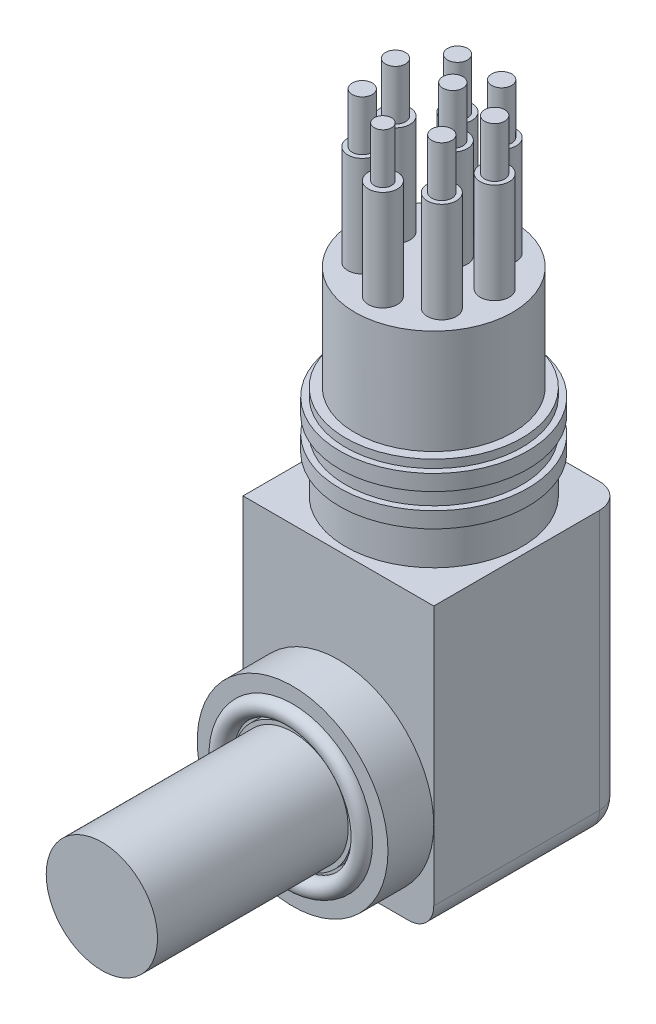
ISO-10303-21;
HEADER;
FILE_DESCRIPTION(('STEP AP214'),'2;1');
FILE_NAME('part.step','',(''),(''),'','','');
FILE_SCHEMA(('AUTOMOTIVE_DESIGN { 1 0 10303 214 1 1 1 1 }'));
ENDSEC;
DATA;
#1=APPLICATION_CONTEXT('core data for automotive mechanical design processes');
#2=APPLICATION_PROTOCOL_DEFINITION('international standard','automotive_design',2000,#1);
#3=PRODUCT_CONTEXT('',#1,'mechanical');
#4=PRODUCT('Part','Part','',(#3));
#5=PRODUCT_RELATED_PRODUCT_CATEGORY('part','',(#4));
#6=PRODUCT_DEFINITION_FORMATION('','',#4);
#7=PRODUCT_DEFINITION_CONTEXT('part definition',#1,'design');
#8=PRODUCT_DEFINITION('design','',#6,#7);
#9=PRODUCT_DEFINITION_SHAPE('','',#8);
#10=(LENGTH_UNIT() NAMED_UNIT(*) SI_UNIT(.MILLI.,.METRE.));
#11=(NAMED_UNIT(*) PLANE_ANGLE_UNIT() SI_UNIT($,.RADIAN.));
#12=(NAMED_UNIT(*) SI_UNIT($,.STERADIAN.) SOLID_ANGLE_UNIT());
#13=UNCERTAINTY_MEASURE_WITH_UNIT(LENGTH_MEASURE(1.E-05),#10,'distance_accuracy_value','');
#14=(GEOMETRIC_REPRESENTATION_CONTEXT(3) GLOBAL_UNCERTAINTY_ASSIGNED_CONTEXT((#13)) GLOBAL_UNIT_ASSIGNED_CONTEXT((#10,
#11,#12)) REPRESENTATION_CONTEXT('',''));
#15=CARTESIAN_POINT('',(0.,0.,0.));
#16=DIRECTION('',(0.,0.,1.));
#17=DIRECTION('',(1.,0.,0.));
#18=AXIS2_PLACEMENT_3D('',#15,#16,#17);
#19=CARTESIAN_POINT('',(3.97170393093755,63.26,3.16732819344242));
#20=DIRECTION('',(0.,-1.,0.));
#21=DIRECTION('',(1.,0.,0.));
#22=AXIS2_PLACEMENT_3D('',#19,#20,#21);
#23=CYLINDRICAL_SURFACE('',#22,1.);
#24=CARTESIAN_POINT('',(3.97170393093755,63.26,3.16732819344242));
#25=DIRECTION('',(0.,1.,0.));
#26=DIRECTION('',(-1.,0.,0.));
#27=AXIS2_PLACEMENT_3D('',#24,#25,#26);
#28=CIRCLE('',#27,1.);
#29=CARTESIAN_POINT('',(2.97170393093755,63.26,3.16732819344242));
#30=VERTEX_POINT('',#29);
#31=EDGE_CURVE('E11',#30,#30,#28,.T.);
#32=ORIENTED_EDGE('',*,*,#31,.F.);
#33=EDGE_LOOP('',(#32));
#34=FACE_BOUND('',#33,.T.);
#35=CARTESIAN_POINT('',(3.97170393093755,58.26,3.16732819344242));
#36=DIRECTION('',(0.,1.,0.));
#37=DIRECTION('',(-1.,0.,0.));
#38=AXIS2_PLACEMENT_3D('',#35,#36,#37);
#39=CIRCLE('',#38,1.);
#40=CARTESIAN_POINT('',(2.97170393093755,58.26,3.16732819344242));
#41=VERTEX_POINT('',#40);
#42=EDGE_CURVE('E48',#41,#41,#39,.T.);
#43=ORIENTED_EDGE('',*,*,#42,.T.);
#44=EDGE_LOOP('',(#43));
#45=FACE_BOUND('',#44,.T.);
#46=ADVANCED_FACE('F42',(#34,#45),#23,.T.);
#47=CARTESIAN_POINT('',(3.97170393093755,63.26,3.16732819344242));
#48=DIRECTION('',(0.,1.,0.));
#49=DIRECTION('',(-1.,0.,0.));
#50=AXIS2_PLACEMENT_3D('',#47,#48,#49);
#51=PLANE('',#50);
#52=ORIENTED_EDGE('',*,*,#31,.T.);
#53=EDGE_LOOP('',(#52));
#54=FACE_BOUND('',#53,.T.);
#55=ADVANCED_FACE('F57',(#54),#51,.T.);
#56=CARTESIAN_POINT('',(3.97170393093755,58.26,3.16732819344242));
#57=DIRECTION('',(0.,1.,0.));
#58=DIRECTION('',(-1.,0.,0.));
#59=AXIS2_PLACEMENT_3D('',#56,#57,#58);
#60=PLANE('',#59);
#61=ORIENTED_EDGE('',*,*,#42,.F.);
#62=EDGE_LOOP('',(#61));
#63=FACE_BOUND('',#62,.T.);
#64=ADVANCED_FACE('F55',(#63),#60,.F.);
#65=CLOSED_SHELL('',(#46,#55,#64));
#66=MANIFOLD_SOLID_BREP('B2',#65);
#67=CARTESIAN_POINT('',(4.95263379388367,63.26,-1.13040634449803));
#68=DIRECTION('',(0.,-1.,0.));
#69=DIRECTION('',(1.,0.,0.));
#70=AXIS2_PLACEMENT_3D('',#67,#68,#69);
#71=CYLINDRICAL_SURFACE('',#70,1.);
#72=CARTESIAN_POINT('',(4.95263379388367,63.26,-1.13040634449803));
#73=DIRECTION('',(0.,1.,0.));
#74=DIRECTION('',(-1.,0.,0.));
#75=AXIS2_PLACEMENT_3D('',#72,#73,#74);
#76=CIRCLE('',#75,1.);
#77=CARTESIAN_POINT('',(3.95263379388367,63.26,-1.13040634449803));
#78=VERTEX_POINT('',#77);
#79=EDGE_CURVE('E41',#78,#78,#76,.T.);
#80=ORIENTED_EDGE('',*,*,#79,.F.);
#81=EDGE_LOOP('',(#80));
#82=FACE_BOUND('',#81,.T.);
#83=CARTESIAN_POINT('',(4.95263379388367,58.26,-1.13040634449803));
#84=DIRECTION('',(0.,1.,0.));
#85=DIRECTION('',(-1.,0.,0.));
#86=AXIS2_PLACEMENT_3D('',#83,#84,#85);
#87=CIRCLE('',#86,1.);
#88=CARTESIAN_POINT('',(3.95263379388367,58.26,-1.13040634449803));
#89=VERTEX_POINT('',#88);
#90=EDGE_CURVE('E97',#89,#89,#87,.T.);
#91=ORIENTED_EDGE('',*,*,#90,.T.);
#92=EDGE_LOOP('',(#91));
#93=FACE_BOUND('',#92,.T.);
#94=ADVANCED_FACE('F91',(#82,#93),#71,.T.);
#95=CARTESIAN_POINT('',(4.95263379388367,63.26,-1.13040634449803));
#96=DIRECTION('',(0.,1.,0.));
#97=DIRECTION('',(-1.,0.,0.));
#98=AXIS2_PLACEMENT_3D('',#95,#96,#97);
#99=PLANE('',#98);
#100=ORIENTED_EDGE('',*,*,#79,.T.);
#101=EDGE_LOOP('',(#100));
#102=FACE_BOUND('',#101,.T.);
#103=ADVANCED_FACE('F106',(#102),#99,.T.);
#104=CARTESIAN_POINT('',(4.95263379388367,58.26,-1.13040634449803));
#105=DIRECTION('',(0.,1.,0.));
#106=DIRECTION('',(-1.,0.,0.));
#107=AXIS2_PLACEMENT_3D('',#104,#105,#106);
#108=PLANE('',#107);
#109=ORIENTED_EDGE('',*,*,#90,.F.);
#110=EDGE_LOOP('',(#109));
#111=FACE_BOUND('',#110,.T.);
#112=ADVANCED_FACE('F104',(#111),#108,.F.);
#113=CLOSED_SHELL('',(#94,#103,#112));
#114=MANIFOLD_SOLID_BREP('B6',#113);
#115=CARTESIAN_POINT('',(2.20412939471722,63.26,-4.57692184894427));
#116=DIRECTION('',(0.,-1.,0.));
#117=DIRECTION('',(1.,0.,0.));
#118=AXIS2_PLACEMENT_3D('',#115,#116,#117);
#119=CYLINDRICAL_SURFACE('',#118,1.);
#120=CARTESIAN_POINT('',(2.20412939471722,63.26,-4.57692184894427));
#121=DIRECTION('',(0.,1.,0.));
#122=DIRECTION('',(-1.,0.,0.));
#123=AXIS2_PLACEMENT_3D('',#120,#121,#122);
#124=CIRCLE('',#123,1.);
#125=CARTESIAN_POINT('',(1.20412939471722,63.26,-4.57692184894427));
#126=VERTEX_POINT('',#125);
#127=EDGE_CURVE('E90',#126,#126,#124,.T.);
#128=ORIENTED_EDGE('',*,*,#127,.F.);
#129=EDGE_LOOP('',(#128));
#130=FACE_BOUND('',#129,.T.);
#131=CARTESIAN_POINT('',(2.20412939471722,58.26,-4.57692184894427));
#132=DIRECTION('',(0.,1.,0.));
#133=DIRECTION('',(-1.,0.,0.));
#134=AXIS2_PLACEMENT_3D('',#131,#132,#133);
#135=CIRCLE('',#134,1.);
#136=CARTESIAN_POINT('',(1.20412939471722,58.26,-4.57692184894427));
#137=VERTEX_POINT('',#136);
#138=EDGE_CURVE('E146',#137,#137,#135,.T.);
#139=ORIENTED_EDGE('',*,*,#138,.T.);
#140=EDGE_LOOP('',(#139));
#141=FACE_BOUND('',#140,.T.);
#142=ADVANCED_FACE('F140',(#130,#141),#119,.T.);
#143=CARTESIAN_POINT('',(2.20412939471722,63.26,-4.57692184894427));
#144=DIRECTION('',(0.,1.,0.));
#145=DIRECTION('',(-1.,0.,0.));
#146=AXIS2_PLACEMENT_3D('',#143,#144,#145);
#147=PLANE('',#146);
#148=ORIENTED_EDGE('',*,*,#127,.T.);
#149=EDGE_LOOP('',(#148));
#150=FACE_BOUND('',#149,.T.);
#151=ADVANCED_FACE('F155',(#150),#147,.T.);
#152=CARTESIAN_POINT('',(2.20412939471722,58.26,-4.57692184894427));
#153=DIRECTION('',(0.,1.,0.));
#154=DIRECTION('',(-1.,0.,0.));
#155=AXIS2_PLACEMENT_3D('',#152,#153,#154);
#156=PLANE('',#155);
#157=ORIENTED_EDGE('',*,*,#138,.F.);
#158=EDGE_LOOP('',(#157));
#159=FACE_BOUND('',#158,.T.);
#160=ADVANCED_FACE('F153',(#159),#156,.F.);
#161=CLOSED_SHELL('',(#142,#151,#160));
#162=MANIFOLD_SOLID_BREP('B36',#161);
#163=CARTESIAN_POINT('',(-2.20412939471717,63.26,-4.5769218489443));
#164=DIRECTION('',(0.,-1.,0.));
#165=DIRECTION('',(1.,0.,0.));
#166=AXIS2_PLACEMENT_3D('',#163,#164,#165);
#167=CYLINDRICAL_SURFACE('',#166,1.);
#168=CARTESIAN_POINT('',(-2.20412939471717,63.26,-4.5769218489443));
#169=DIRECTION('',(0.,1.,0.));
#170=DIRECTION('',(-1.,0.,0.));
#171=AXIS2_PLACEMENT_3D('',#168,#169,#170);
#172=CIRCLE('',#171,1.);
#173=CARTESIAN_POINT('',(-3.20412939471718,63.26,-4.5769218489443));
#174=VERTEX_POINT('',#173);
#175=EDGE_CURVE('E139',#174,#174,#172,.T.);
#176=ORIENTED_EDGE('',*,*,#175,.F.);
#177=EDGE_LOOP('',(#176));
#178=FACE_BOUND('',#177,.T.);
#179=CARTESIAN_POINT('',(-2.20412939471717,58.26,-4.5769218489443));
#180=DIRECTION('',(0.,1.,0.));
#181=DIRECTION('',(-1.,0.,0.));
#182=AXIS2_PLACEMENT_3D('',#179,#180,#181);
#183=CIRCLE('',#182,1.);
#184=CARTESIAN_POINT('',(-3.20412939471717,58.26,-4.5769218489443));
#185=VERTEX_POINT('',#184);
#186=EDGE_CURVE('E195',#185,#185,#183,.T.);
#187=ORIENTED_EDGE('',*,*,#186,.T.);
#188=EDGE_LOOP('',(#187));
#189=FACE_BOUND('',#188,.T.);
#190=ADVANCED_FACE('F189',(#178,#189),#167,.T.);
#191=CARTESIAN_POINT('',(-2.20412939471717,63.26,-4.5769218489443));
#192=DIRECTION('',(0.,1.,0.));
#193=DIRECTION('',(-1.,0.,0.));
#194=AXIS2_PLACEMENT_3D('',#191,#192,#193);
#195=PLANE('',#194);
#196=ORIENTED_EDGE('',*,*,#175,.T.);
#197=EDGE_LOOP('',(#196));
#198=FACE_BOUND('',#197,.T.);
#199=ADVANCED_FACE('F204',(#198),#195,.T.);
#200=CARTESIAN_POINT('',(-2.20412939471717,58.26,-4.5769218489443));
#201=DIRECTION('',(0.,1.,0.));
#202=DIRECTION('',(-1.,0.,0.));
#203=AXIS2_PLACEMENT_3D('',#200,#201,#202);
#204=PLANE('',#203);
#205=ORIENTED_EDGE('',*,*,#186,.F.);
#206=EDGE_LOOP('',(#205));
#207=FACE_BOUND('',#206,.T.);
#208=ADVANCED_FACE('F202',(#207),#204,.F.);
#209=CLOSED_SHELL('',(#190,#199,#208));
#210=MANIFOLD_SOLID_BREP('B85',#209);
#211=CARTESIAN_POINT('',(-4.95263379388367,63.26,-1.1304063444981));
#212=DIRECTION('',(0.,-1.,0.));
#213=DIRECTION('',(1.,0.,0.));
#214=AXIS2_PLACEMENT_3D('',#211,#212,#213);
#215=CYLINDRICAL_SURFACE('',#214,1.);
#216=CARTESIAN_POINT('',(-4.95263379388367,63.26,-1.1304063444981));
#217=DIRECTION('',(0.,1.,0.));
#218=DIRECTION('',(-1.,0.,0.));
#219=AXIS2_PLACEMENT_3D('',#216,#217,#218);
#220=CIRCLE('',#219,1.);
#221=CARTESIAN_POINT('',(-5.95263379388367,63.26,-1.1304063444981));
#222=VERTEX_POINT('',#221);
#223=EDGE_CURVE('E188',#222,#222,#220,.T.);
#224=ORIENTED_EDGE('',*,*,#223,.F.);
#225=EDGE_LOOP('',(#224));
#226=FACE_BOUND('',#225,.T.);
#227=CARTESIAN_POINT('',(-4.95263379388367,58.26,-1.1304063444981));
#228=DIRECTION('',(0.,1.,0.));
#229=DIRECTION('',(-1.,0.,0.));
#230=AXIS2_PLACEMENT_3D('',#227,#228,#229);
#231=CIRCLE('',#230,1.);
#232=CARTESIAN_POINT('',(-5.95263379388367,58.26,-1.1304063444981));
#233=VERTEX_POINT('',#232);
#234=EDGE_CURVE('E244',#233,#233,#231,.T.);
#235=ORIENTED_EDGE('',*,*,#234,.T.);
#236=EDGE_LOOP('',(#235));
#237=FACE_BOUND('',#236,.T.);
#238=ADVANCED_FACE('F238',(#226,#237),#215,.T.);
#239=CARTESIAN_POINT('',(-4.95263379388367,63.26,-1.1304063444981));
#240=DIRECTION('',(0.,1.,0.));
#241=DIRECTION('',(-1.,0.,0.));
#242=AXIS2_PLACEMENT_3D('',#239,#240,#241);
#243=PLANE('',#242);
#244=ORIENTED_EDGE('',*,*,#223,.T.);
#245=EDGE_LOOP('',(#244));
#246=FACE_BOUND('',#245,.T.);
#247=ADVANCED_FACE('F253',(#246),#243,.T.);
#248=CARTESIAN_POINT('',(-4.95263379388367,58.26,-1.1304063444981));
#249=DIRECTION('',(0.,1.,0.));
#250=DIRECTION('',(-1.,0.,0.));
#251=AXIS2_PLACEMENT_3D('',#248,#249,#250);
#252=PLANE('',#251);
#253=ORIENTED_EDGE('',*,*,#234,.F.);
#254=EDGE_LOOP('',(#253));
#255=FACE_BOUND('',#254,.T.);
#256=ADVANCED_FACE('F251',(#255),#252,.F.);
#257=CLOSED_SHELL('',(#238,#247,#256));
#258=MANIFOLD_SOLID_BREP('B134',#257);
#259=CARTESIAN_POINT('',(-3.97170393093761,63.26,3.16732819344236));
#260=DIRECTION('',(0.,-1.,0.));
#261=DIRECTION('',(1.,0.,0.));
#262=AXIS2_PLACEMENT_3D('',#259,#260,#261);
#263=CYLINDRICAL_SURFACE('',#262,1.);
#264=CARTESIAN_POINT('',(-3.97170393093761,63.26,3.16732819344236));
#265=DIRECTION('',(0.,1.,0.));
#266=DIRECTION('',(-1.,0.,0.));
#267=AXIS2_PLACEMENT_3D('',#264,#265,#266);
#268=CIRCLE('',#267,1.);
#269=CARTESIAN_POINT('',(-4.97170393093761,63.26,3.16732819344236));
#270=VERTEX_POINT('',#269);
#271=EDGE_CURVE('E237',#270,#270,#268,.T.);
#272=ORIENTED_EDGE('',*,*,#271,.F.);
#273=EDGE_LOOP('',(#272));
#274=FACE_BOUND('',#273,.T.);
#275=CARTESIAN_POINT('',(-3.9717039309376,58.26,3.16732819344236));
#276=DIRECTION('',(0.,1.,0.));
#277=DIRECTION('',(-1.,0.,0.));
#278=AXIS2_PLACEMENT_3D('',#275,#276,#277);
#279=CIRCLE('',#278,1.);
#280=CARTESIAN_POINT('',(-4.9717039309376,58.26,3.16732819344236));
#281=VERTEX_POINT('',#280);
#282=EDGE_CURVE('E293',#281,#281,#279,.T.);
#283=ORIENTED_EDGE('',*,*,#282,.T.);
#284=EDGE_LOOP('',(#283));
#285=FACE_BOUND('',#284,.T.);
#286=ADVANCED_FACE('F287',(#274,#285),#263,.T.);
#287=CARTESIAN_POINT('',(-3.97170393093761,63.26,3.16732819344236));
#288=DIRECTION('',(0.,1.,0.));
#289=DIRECTION('',(-1.,0.,0.));
#290=AXIS2_PLACEMENT_3D('',#287,#288,#289);
#291=PLANE('',#290);
#292=ORIENTED_EDGE('',*,*,#271,.T.);
#293=EDGE_LOOP('',(#292));
#294=FACE_BOUND('',#293,.T.);
#295=ADVANCED_FACE('F302',(#294),#291,.T.);
#296=CARTESIAN_POINT('',(-3.9717039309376,58.26,3.16732819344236));
#297=DIRECTION('',(0.,1.,0.));
#298=DIRECTION('',(-1.,0.,0.));
#299=AXIS2_PLACEMENT_3D('',#296,#297,#298);
#300=PLANE('',#299);
#301=ORIENTED_EDGE('',*,*,#282,.F.);
#302=EDGE_LOOP('',(#301));
#303=FACE_BOUND('',#302,.T.);
#304=ADVANCED_FACE('F300',(#303),#300,.F.);
#305=CLOSED_SHELL('',(#286,#295,#304));
#306=MANIFOLD_SOLID_BREP('B183',#305);
#307=CARTESIAN_POINT('',(0.,63.26,-1.905));
#308=DIRECTION('',(0.,-1.,0.));
#309=DIRECTION('',(1.,0.,0.));
#310=AXIS2_PLACEMENT_3D('',#307,#308,#309);
#311=CYLINDRICAL_SURFACE('',#310,1.);
#312=CARTESIAN_POINT('',(0.,63.26,-1.905));
#313=DIRECTION('',(0.,1.,0.));
#314=DIRECTION('',(-1.,0.,0.));
#315=AXIS2_PLACEMENT_3D('',#312,#313,#314);
#316=CIRCLE('',#315,1.);
#317=CARTESIAN_POINT('',(-1.00000000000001,63.26,-1.905));
#318=VERTEX_POINT('',#317);
#319=EDGE_CURVE('E286',#318,#318,#316,.T.);
#320=ORIENTED_EDGE('',*,*,#319,.F.);
#321=EDGE_LOOP('',(#320));
#322=FACE_BOUND('',#321,.T.);
#323=CARTESIAN_POINT('',(0.,58.26,-1.905));
#324=DIRECTION('',(0.,1.,0.));
#325=DIRECTION('',(-1.,0.,0.));
#326=AXIS2_PLACEMENT_3D('',#323,#324,#325);
#327=CIRCLE('',#326,1.);
#328=CARTESIAN_POINT('',(-1.00000000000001,58.26,-1.905));
#329=VERTEX_POINT('',#328);
#330=EDGE_CURVE('E342',#329,#329,#327,.T.);
#331=ORIENTED_EDGE('',*,*,#330,.T.);
#332=EDGE_LOOP('',(#331));
#333=FACE_BOUND('',#332,.T.);
#334=ADVANCED_FACE('F336',(#322,#333),#311,.T.);
#335=CARTESIAN_POINT('',(0.,63.26,-1.905));
#336=DIRECTION('',(0.,1.,0.));
#337=DIRECTION('',(-1.,0.,0.));
#338=AXIS2_PLACEMENT_3D('',#335,#336,#337);
#339=PLANE('',#338);
#340=ORIENTED_EDGE('',*,*,#319,.T.);
#341=EDGE_LOOP('',(#340));
#342=FACE_BOUND('',#341,.T.);
#343=ADVANCED_FACE('F351',(#342),#339,.T.);
#344=CARTESIAN_POINT('',(0.,58.26,-1.905));
#345=DIRECTION('',(0.,1.,0.));
#346=DIRECTION('',(-1.,0.,0.));
#347=AXIS2_PLACEMENT_3D('',#344,#345,#346);
#348=PLANE('',#347);
#349=ORIENTED_EDGE('',*,*,#330,.F.);
#350=EDGE_LOOP('',(#349));
#351=FACE_BOUND('',#350,.T.);
#352=ADVANCED_FACE('F349',(#351),#348,.F.);
#353=CLOSED_SHELL('',(#334,#343,#352));
#354=MANIFOLD_SOLID_BREP('B232',#353);
#355=CARTESIAN_POINT('',(0.,63.26,5.08));
#356=DIRECTION('',(0.,-1.,0.));
#357=DIRECTION('',(1.,0.,0.));
#358=AXIS2_PLACEMENT_3D('',#355,#356,#357);
#359=CYLINDRICAL_SURFACE('',#358,0.8648274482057);
#360=CARTESIAN_POINT('',(0.,63.26,5.08));
#361=DIRECTION('',(0.,1.,0.));
#362=DIRECTION('',(-1.,0.,0.));
#363=AXIS2_PLACEMENT_3D('',#360,#361,#362);
#364=CIRCLE('',#363,0.8648274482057);
#365=CARTESIAN_POINT('',(-0.864827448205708,63.26,5.08));
#366=VERTEX_POINT('',#365);
#367=EDGE_CURVE('E335',#366,#366,#364,.T.);
#368=ORIENTED_EDGE('',*,*,#367,.F.);
#369=EDGE_LOOP('',(#368));
#370=FACE_BOUND('',#369,.T.);
#371=CARTESIAN_POINT('',(0.,58.26,5.08));
#372=DIRECTION('',(0.,1.,0.));
#373=DIRECTION('',(-1.,0.,0.));
#374=AXIS2_PLACEMENT_3D('',#371,#372,#373);
#375=CIRCLE('',#374,0.8648274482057);
#376=CARTESIAN_POINT('',(-0.864827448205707,58.26,5.08));
#377=VERTEX_POINT('',#376);
#378=EDGE_CURVE('E392',#377,#377,#375,.T.);
#379=ORIENTED_EDGE('',*,*,#378,.T.);
#380=EDGE_LOOP('',(#379));
#381=FACE_BOUND('',#380,.T.);
#382=ADVANCED_FACE('F386',(#370,#381),#359,.T.);
#383=CARTESIAN_POINT('',(0.,63.26,5.08));
#384=DIRECTION('',(0.,1.,0.));
#385=DIRECTION('',(-1.,0.,0.));
#386=AXIS2_PLACEMENT_3D('',#383,#384,#385);
#387=PLANE('',#386);
#388=ORIENTED_EDGE('',*,*,#367,.T.);
#389=EDGE_LOOP('',(#388));
#390=FACE_BOUND('',#389,.T.);
#391=ADVANCED_FACE('F401',(#390),#387,.T.);
#392=CARTESIAN_POINT('',(0.,58.26,5.08));
#393=DIRECTION('',(0.,1.,0.));
#394=DIRECTION('',(-1.,0.,0.));
#395=AXIS2_PLACEMENT_3D('',#392,#393,#394);
#396=PLANE('',#395);
#397=ORIENTED_EDGE('',*,*,#378,.F.);
#398=EDGE_LOOP('',(#397));
#399=FACE_BOUND('',#398,.T.);
#400=ADVANCED_FACE('F399',(#399),#396,.F.);
#401=CLOSED_SHELL('',(#382,#391,#400));
#402=MANIFOLD_SOLID_BREP('B281',#401);
#403=CARTESIAN_POINT('',(0.,48.26,0.));
#404=DIRECTION('',(0.,1.,0.));
#405=DIRECTION('',(-1.,0.,0.));
#406=AXIS2_PLACEMENT_3D('',#403,#404,#405);
#407=PLANE('',#406);
#408=CARTESIAN_POINT('',(4.95263379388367,48.26,-1.13040634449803));
#409=DIRECTION('',(0.,1.,0.));
#410=DIRECTION('',(0.222520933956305,0.,0.974927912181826));
#411=AXIS2_PLACEMENT_3D('',#408,#409,#410);
#412=CIRCLE('',#411,1.45);
#413=CARTESIAN_POINT('',(5.27528914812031,48.26,0.283239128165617));
#414=VERTEX_POINT('',#413);
#415=EDGE_CURVE('E1175',#414,#414,#412,.T.);
#416=ORIENTED_EDGE('',*,*,#415,.F.);
#417=EDGE_LOOP('',(#416));
#418=FACE_BOUND('',#417,.T.);
#419=CARTESIAN_POINT('',(-2.20412939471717,48.26,-4.5769218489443));
#420=DIRECTION('',(0.,1.,0.));
#421=DIRECTION('',(0.900968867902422,0.,-0.433883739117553));
#422=AXIS2_PLACEMENT_3D('',#419,#420,#421);
#423=CIRCLE('',#422,1.45);
#424=CARTESIAN_POINT('',(-0.897724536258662,48.26,-5.20605327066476));
#425=VERTEX_POINT('',#424);
#426=EDGE_CURVE('E1192',#425,#425,#423,.T.);
#427=ORIENTED_EDGE('',*,*,#426,.F.);
#428=EDGE_LOOP('',(#427));
#429=FACE_BOUND('',#428,.T.);
#430=CARTESIAN_POINT('',(-3.9717039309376,48.26,3.16732819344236));
#431=DIRECTION('',(0.,1.,0.));
#432=DIRECTION('',(-0.623489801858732,0.,-0.781831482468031));
#433=AXIS2_PLACEMENT_3D('',#430,#431,#432);
#434=CIRCLE('',#433,1.45);
#435=CARTESIAN_POINT('',(-4.87576414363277,48.26,2.03367254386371));
#436=VERTEX_POINT('',#435);
#437=EDGE_CURVE('E1204',#436,#436,#434,.T.);
#438=ORIENTED_EDGE('',*,*,#437,.F.);
#439=EDGE_LOOP('',(#438));
#440=FACE_BOUND('',#439,.T.);
#441=CARTESIAN_POINT('',(0.,48.26,5.08));
#442=DIRECTION('',(0.,1.,0.));
#443=DIRECTION('',(-1.,0.,0.));
#444=AXIS2_PLACEMENT_3D('',#441,#442,#443);
#445=CIRCLE('',#444,1.45);
#446=CARTESIAN_POINT('',(-1.45000000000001,48.26,5.08));
#447=VERTEX_POINT('',#446);
#448=EDGE_CURVE('E1216',#447,#447,#445,.T.);
#449=ORIENTED_EDGE('',*,*,#448,.F.);
#450=EDGE_LOOP('',(#449));
#451=FACE_BOUND('',#450,.T.);
#452=CARTESIAN_POINT('',(0.,48.26,0.));
#453=DIRECTION('',(0.,1.,0.));
#454=DIRECTION('',(-1.,0.,0.));
#455=AXIS2_PLACEMENT_3D('',#452,#453,#454);
#456=CIRCLE('',#455,7.874);
#457=CARTESIAN_POINT('',(-7.874,48.26,0.));
#458=VERTEX_POINT('',#457);
#459=EDGE_CURVE('E546',#458,#458,#456,.T.);
#460=ORIENTED_EDGE('',*,*,#459,.T.);
#461=EDGE_LOOP('',(#460));
#462=FACE_BOUND('',#461,.T.);
#463=CARTESIAN_POINT('',(0.,48.26,-1.905));
#464=DIRECTION('',(0.,1.,0.));
#465=DIRECTION('',(-1.,0.,0.));
#466=AXIS2_PLACEMENT_3D('',#463,#464,#465);
#467=CIRCLE('',#466,1.45);
#468=CARTESIAN_POINT('',(-1.45000000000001,48.26,-1.905));
#469=VERTEX_POINT('',#468);
#470=EDGE_CURVE('E1210',#469,#469,#467,.T.);
#471=ORIENTED_EDGE('',*,*,#470,.F.);
#472=EDGE_LOOP('',(#471));
#473=FACE_BOUND('',#472,.T.);
#474=CARTESIAN_POINT('',(-4.95263379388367,48.26,-1.1304063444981));
#475=DIRECTION('',(0.,1.,0.));
#476=DIRECTION('',(0.222520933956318,0.,-0.974927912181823));
#477=AXIS2_PLACEMENT_3D('',#474,#475,#476);
#478=CIRCLE('',#477,1.45);
#479=CARTESIAN_POINT('',(-4.629978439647,48.26,-2.54405181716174));
#480=VERTEX_POINT('',#479);
#481=EDGE_CURVE('E1198',#480,#480,#478,.T.);
#482=ORIENTED_EDGE('',*,*,#481,.F.);
#483=EDGE_LOOP('',(#482));
#484=FACE_BOUND('',#483,.T.);
#485=CARTESIAN_POINT('',(2.20412939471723,48.26,-4.57692184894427));
#486=DIRECTION('',(0.,1.,0.));
#487=DIRECTION('',(0.900968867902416,0.,0.433883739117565));
#488=AXIS2_PLACEMENT_3D('',#485,#486,#487);
#489=CIRCLE('',#488,1.45);
#490=CARTESIAN_POINT('',(3.51053425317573,48.26,-3.9477904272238));
#491=VERTEX_POINT('',#490);
#492=EDGE_CURVE('E1186',#491,#491,#489,.T.);
#493=ORIENTED_EDGE('',*,*,#492,.F.);
#494=EDGE_LOOP('',(#493));
#495=FACE_BOUND('',#494,.T.);
#496=CARTESIAN_POINT('',(3.97170393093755,48.26,3.16732819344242));
#497=DIRECTION('',(0.,1.,0.));
#498=DIRECTION('',(-0.623489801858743,0.,0.781831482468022));
#499=AXIS2_PLACEMENT_3D('',#496,#497,#498);
#500=CIRCLE('',#499,1.45);
#501=CARTESIAN_POINT('',(3.06764371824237,48.26,4.30098384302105));
#502=VERTEX_POINT('',#501);
#503=EDGE_CURVE('E1176',#502,#502,#500,.T.);
#504=ORIENTED_EDGE('',*,*,#503,.F.);
#505=EDGE_LOOP('',(#504));
#506=FACE_BOUND('',#505,.T.);
#507=ADVANCED_FACE('F427',(#418,#429,#440,#451,#462,#473,#484,#495,#506),#407,.T.);
#508=CARTESIAN_POINT('',(0.,9.525,14.097));
#509=DIRECTION('',(0.,0.,1.));
#510=DIRECTION('',(1.,0.,0.));
#511=AXIS2_PLACEMENT_3D('',#508,#509,#510);
#512=PLANE('',#511);
#513=CARTESIAN_POINT('',(0.,9.525,14.097));
#514=DIRECTION('',(0.,0.,1.));
#515=DIRECTION('',(1.,0.,0.));
#516=AXIS2_PLACEMENT_3D('',#513,#514,#515);
#517=CIRCLE('',#516,9.525);
#518=CARTESIAN_POINT('',(9.525,9.525,14.097));
#519=VERTEX_POINT('',#518);
#520=EDGE_CURVE('E532',#519,#519,#517,.T.);
#521=ORIENTED_EDGE('',*,*,#520,.T.);
#522=EDGE_LOOP('',(#521));
#523=FACE_BOUND('',#522,.T.);
#524=CARTESIAN_POINT('',(0.,9.525,14.097));
#525=DIRECTION('',(0.,0.,1.));
#526=DIRECTION('',(1.,0.,0.));
#527=AXIS2_PLACEMENT_3D('',#524,#525,#526);
#528=CIRCLE('',#527,7.99);
#529=CARTESIAN_POINT('',(7.99,9.525,14.097));
#530=VERTEX_POINT('',#529);
#531=EDGE_CURVE('E655',#530,#530,#528,.F.);
#532=ORIENTED_EDGE('',*,*,#531,.T.);
#533=EDGE_LOOP('',(#532));
#534=FACE_BOUND('',#533,.T.);
#535=ADVANCED_FACE('F697',(#523,#534),#512,.T.);
#536=CARTESIAN_POINT('',(-9.525,28.448,9.525));
#537=DIRECTION('',(0.,0.,-1.));
#538=DIRECTION('',(-1.,0.,0.));
#539=AXIS2_PLACEMENT_3D('',#536,#537,#538);
#540=PLANE('',#539);
#541=CARTESIAN_POINT('',(0.,9.525,9.525));
#542=DIRECTION('',(0.,0.,1.));
#543=DIRECTION('',(1.,0.,0.));
#544=AXIS2_PLACEMENT_3D('',#541,#542,#543);
#545=CIRCLE('',#544,9.525);
#546=CARTESIAN_POINT('',(9.525,9.525,9.525));
#547=VERTEX_POINT('',#546);
#548=CARTESIAN_POINT('',(-9.525,9.525,9.525));
#549=VERTEX_POINT('',#548);
#550=EDGE_CURVE('E526',#547,#549,#545,.T.);
#551=ORIENTED_EDGE('',*,*,#550,.F.);
#552=DIRECTION('',(0.,-1.,0.));
#553=VECTOR('',#552,1.);
#554=CARTESIAN_POINT('',(9.525,28.448,9.525));
#555=LINE('',#554,#553);
#556=CARTESIAN_POINT('',(9.525,28.448,9.525));
#557=VERTEX_POINT('',#556);
#558=EDGE_CURVE('E501',#557,#547,#555,.T.);
#559=ORIENTED_EDGE('',*,*,#558,.F.);
#560=DIRECTION('',(1.,0.,0.));
#561=VECTOR('',#560,1.);
#562=CARTESIAN_POINT('',(-9.525,28.448,9.525));
#563=LINE('',#562,#561);
#564=CARTESIAN_POINT('',(-9.525,28.448,9.525));
#565=VERTEX_POINT('',#564);
#566=EDGE_CURVE('E584',#565,#557,#563,.T.);
#567=ORIENTED_EDGE('',*,*,#566,.F.);
#568=DIRECTION('',(0.,-1.,0.));
#569=VECTOR('',#568,1.);
#570=CARTESIAN_POINT('',(-9.525,28.448,9.525));
#571=LINE('',#570,#569);
#572=EDGE_CURVE('E529',#565,#549,#571,.T.);
#573=ORIENTED_EDGE('',*,*,#572,.T.);
#574=EDGE_LOOP('',(#551,#559,#567,#573));
#575=FACE_BOUND('',#574,.T.);
#576=ADVANCED_FACE('F527',(#575),#540,.F.);
#577=CARTESIAN_POINT('',(-9.525,2.5,9.525));
#578=VERTEX_POINT('',#577);
#579=EDGE_CURVE('E512',#549,#578,#571,.T.);
#580=ORIENTED_EDGE('',*,*,#579,.T.);
#581=CARTESIAN_POINT('',(-7.025,2.5,9.525));
#582=DIRECTION('',(0.,0.,-1.));
#583=DIRECTION('',(-1.,0.,0.));
#584=AXIS2_PLACEMENT_3D('',#581,#582,#583);
#585=CIRCLE('',#584,2.5);
#586=CARTESIAN_POINT('',(-7.025,0.,9.525));
#587=VERTEX_POINT('',#586);
#588=EDGE_CURVE('E614',#578,#587,#585,.F.);
#589=ORIENTED_EDGE('',*,*,#588,.T.);
#590=DIRECTION('',(1.,0.,0.));
#591=VECTOR('',#590,1.);
#592=CARTESIAN_POINT('',(-9.525,0.,9.525));
#593=LINE('',#592,#591);
#594=CARTESIAN_POINT('',(0.,0.,9.525));
#595=VERTEX_POINT('',#594);
#596=EDGE_CURVE('E580',#587,#595,#593,.T.);
#597=ORIENTED_EDGE('',*,*,#596,.T.);
#598=EDGE_CURVE('E535',#549,#595,#545,.T.);
#599=ORIENTED_EDGE('',*,*,#598,.F.);
#600=EDGE_LOOP('',(#580,#589,#597,#599));
#601=FACE_BOUND('',#600,.T.);
#602=ADVANCED_FACE('F762',(#601),#540,.F.);
#603=CARTESIAN_POINT('',(7.025,0.,9.525));
#604=VERTEX_POINT('',#603);
#605=EDGE_CURVE('E579',#595,#604,#593,.T.);
#606=ORIENTED_EDGE('',*,*,#605,.T.);
#607=CARTESIAN_POINT('',(7.025,2.5,9.525));
#608=DIRECTION('',(0.,0.,-1.));
#609=DIRECTION('',(-1.,0.,0.));
#610=AXIS2_PLACEMENT_3D('',#607,#608,#609);
#611=CIRCLE('',#610,2.5);
#612=CARTESIAN_POINT('',(9.525,2.5,9.525));
#613=VERTEX_POINT('',#612);
#614=EDGE_CURVE('E522',#604,#613,#611,.F.);
#615=ORIENTED_EDGE('',*,*,#614,.T.);
#616=EDGE_CURVE('E505',#547,#613,#555,.T.);
#617=ORIENTED_EDGE('',*,*,#616,.F.);
#618=EDGE_CURVE('E519',#595,#547,#545,.T.);
#619=ORIENTED_EDGE('',*,*,#618,.F.);
#620=EDGE_LOOP('',(#606,#615,#617,#619));
#621=FACE_BOUND('',#620,.T.);
#622=ADVANCED_FACE('F517',(#621),#540,.F.);
#623=CARTESIAN_POINT('',(8.8011,37.846,0.));
#624=DIRECTION('',(0.,-1.,0.));
#625=DIRECTION('',(1.,0.,0.));
#626=AXIS2_PLACEMENT_3D('',#623,#624,#625);
#627=PLANE('',#626);
#628=CARTESIAN_POINT('',(0.,37.846,0.));
#629=DIRECTION('',(0.,1.,0.));
#630=DIRECTION('',(-1.,0.,0.));
#631=AXIS2_PLACEMENT_3D('',#628,#629,#630);
#632=CIRCLE('',#631,8.8011);
#633=CARTESIAN_POINT('',(-8.80110000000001,37.846,0.));
#634=VERTEX_POINT('',#633);
#635=EDGE_CURVE('E576',#634,#634,#632,.T.);
#636=ORIENTED_EDGE('',*,*,#635,.T.);
#637=EDGE_LOOP('',(#636));
#638=FACE_BOUND('',#637,.T.);
#639=CARTESIAN_POINT('',(0.,37.846,0.));
#640=DIRECTION('',(0.,-1.,0.));
#641=DIRECTION('',(1.,0.,0.));
#642=AXIS2_PLACEMENT_3D('',#639,#640,#641);
#643=CIRCLE('',#642,7.874);
#644=CARTESIAN_POINT('',(7.87399999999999,37.846,0.));
#645=VERTEX_POINT('',#644);
#646=EDGE_CURVE('E537',#645,#645,#643,.F.);
#647=ORIENTED_EDGE('',*,*,#646,.F.);
#648=EDGE_LOOP('',(#647));
#649=FACE_BOUND('',#648,.T.);
#650=ADVANCED_FACE('F749',(#638,#649),#627,.F.);
#651=CARTESIAN_POINT('',(-9.525,28.448,-9.525));
#652=DIRECTION('',(0.,1.,0.));
#653=DIRECTION('',(0.,0.,1.));
#654=AXIS2_PLACEMENT_3D('',#651,#652,#653);
#655=PLANE('',#654);
#656=DIRECTION('',(-1.,0.,0.));
#657=VECTOR('',#656,1.);
#658=CARTESIAN_POINT('',(-9.525,28.448,-9.525));
#659=LINE('',#658,#657);
#660=CARTESIAN_POINT('',(7.02499999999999,28.448,-9.525));
#661=VERTEX_POINT('',#660);
#662=CARTESIAN_POINT('',(-7.025,28.448,-9.525));
#663=VERTEX_POINT('',#662);
#664=EDGE_CURVE('E523',#661,#663,#659,.T.);
#665=ORIENTED_EDGE('',*,*,#664,.T.);
#666=CARTESIAN_POINT('',(-7.025,28.448,-7.025));
#667=DIRECTION('',(0.,1.,0.));
#668=DIRECTION('',(0.,0.,1.));
#669=AXIS2_PLACEMENT_3D('',#666,#667,#668);
#670=CIRCLE('',#669,2.5);
#671=CARTESIAN_POINT('',(-9.525,28.448,-7.025));
#672=VERTEX_POINT('',#671);
#673=EDGE_CURVE('E384',#663,#672,#670,.T.);
#674=ORIENTED_EDGE('',*,*,#673,.T.);
#675=DIRECTION('',(0.,0.,1.));
#676=VECTOR('',#675,1.);
#677=CARTESIAN_POINT('',(-9.525,28.448,-9.525));
#678=LINE('',#677,#676);
#679=EDGE_CURVE('E582',#672,#565,#678,.T.);
#680=ORIENTED_EDGE('',*,*,#679,.T.);
#681=ORIENTED_EDGE('',*,*,#566,.T.);
#682=DIRECTION('',(0.,0.,-1.));
#683=VECTOR('',#682,1.);
#684=CARTESIAN_POINT('',(9.525,28.448,-9.525));
#685=LINE('',#684,#683);
#686=CARTESIAN_POINT('',(9.525,28.448,-7.025));
#687=VERTEX_POINT('',#686);
#688=EDGE_CURVE('E508',#557,#687,#685,.T.);
#689=ORIENTED_EDGE('',*,*,#688,.T.);
#690=CARTESIAN_POINT('',(7.025,28.448,-7.025));
#691=DIRECTION('',(0.,1.,0.));
#692=DIRECTION('',(0.,0.,1.));
#693=AXIS2_PLACEMENT_3D('',#690,#691,#692);
#694=CIRCLE('',#693,2.5);
#695=EDGE_CURVE('E435',#687,#661,#694,.T.);
#696=ORIENTED_EDGE('',*,*,#695,.T.);
#697=EDGE_LOOP('',(#665,#674,#680,#681,#689,#696));
#698=FACE_BOUND('',#697,.T.);
#699=CARTESIAN_POINT('',(0.,28.448,0.));
#700=DIRECTION('',(0.,1.,0.));
#701=DIRECTION('',(-1.,0.,0.));
#702=AXIS2_PLACEMENT_3D('',#699,#700,#701);
#703=CIRCLE('',#702,8.8011);
#704=CARTESIAN_POINT('',(-8.80110000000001,28.448,0.));
#705=VERTEX_POINT('',#704);
#706=EDGE_CURVE('E549',#705,#705,#703,.T.);
#707=ORIENTED_EDGE('',*,*,#706,.F.);
#708=EDGE_LOOP('',(#707));
#709=FACE_BOUND('',#708,.T.);
#710=ADVANCED_FACE('F617',(#698,#709),#655,.T.);
#711=CARTESIAN_POINT('',(-9.525,28.448,-9.525));
#712=DIRECTION('',(1.,0.,0.));
#713=DIRECTION('',(0.,0.,-1.));
#714=AXIS2_PLACEMENT_3D('',#711,#712,#713);
#715=PLANE('',#714);
#716=DIRECTION('',(0.,-1.,0.));
#717=VECTOR('',#716,1.);
#718=CARTESIAN_POINT('',(-9.525,28.448,-7.025));
#719=LINE('',#718,#717);
#720=CARTESIAN_POINT('',(-9.525,2.5,-7.025));
#721=VERTEX_POINT('',#720);
#722=EDGE_CURVE('E442',#672,#721,#719,.T.);
#723=ORIENTED_EDGE('',*,*,#722,.T.);
#724=DIRECTION('',(0.,0.,1.));
#725=VECTOR('',#724,1.);
#726=CARTESIAN_POINT('',(-9.525,2.5,-9.525));
#727=LINE('',#726,#725);
#728=EDGE_CURVE('E612',#721,#578,#727,.T.);
#729=ORIENTED_EDGE('',*,*,#728,.T.);
#730=ORIENTED_EDGE('',*,*,#579,.F.);
#731=ORIENTED_EDGE('',*,*,#572,.F.);
#732=ORIENTED_EDGE('',*,*,#679,.F.);
#733=EDGE_LOOP('',(#723,#729,#730,#731,#732));
#734=FACE_BOUND('',#733,.T.);
#735=ADVANCED_FACE('F429',(#734),#715,.F.);
#736=CARTESIAN_POINT('',(9.525,28.448,-9.525));
#737=DIRECTION('',(-1.,0.,0.));
#738=DIRECTION('',(0.,0.,1.));
#739=AXIS2_PLACEMENT_3D('',#736,#737,#738);
#740=PLANE('',#739);
#741=ORIENTED_EDGE('',*,*,#616,.T.);
#742=DIRECTION('',(0.,0.,-1.));
#743=VECTOR('',#742,1.);
#744=CARTESIAN_POINT('',(9.525,2.5,-9.525));
#745=LINE('',#744,#743);
#746=CARTESIAN_POINT('',(9.525,2.5,-7.025));
#747=VERTEX_POINT('',#746);
#748=EDGE_CURVE('E596',#613,#747,#745,.T.);
#749=ORIENTED_EDGE('',*,*,#748,.T.);
#750=DIRECTION('',(0.,-1.,0.));
#751=VECTOR('',#750,1.);
#752=CARTESIAN_POINT('',(9.525,28.448,-7.025));
#753=LINE('',#752,#751);
#754=EDGE_CURVE('E594',#747,#687,#753,.F.);
#755=ORIENTED_EDGE('',*,*,#754,.T.);
#756=ORIENTED_EDGE('',*,*,#688,.F.);
#757=ORIENTED_EDGE('',*,*,#558,.T.);
#758=EDGE_LOOP('',(#741,#749,#755,#756,#757));
#759=FACE_BOUND('',#758,.T.);
#760=ADVANCED_FACE('F503',(#759),#740,.F.);
#761=CARTESIAN_POINT('',(-9.525,28.448,-9.525));
#762=DIRECTION('',(0.,0.,1.));
#763=DIRECTION('',(1.,0.,0.));
#764=AXIS2_PLACEMENT_3D('',#761,#762,#763);
#765=PLANE('',#764);
#766=DIRECTION('',(-1.,0.,0.));
#767=VECTOR('',#766,1.);
#768=CARTESIAN_POINT('',(-9.525,2.5,-9.525));
#769=LINE('',#768,#767);
#770=CARTESIAN_POINT('',(7.025,2.5,-9.525));
#771=VERTEX_POINT('',#770);
#772=CARTESIAN_POINT('',(-7.025,2.5,-9.525));
#773=VERTEX_POINT('',#772);
#774=EDGE_CURVE('E607',#771,#773,#769,.T.);
#775=ORIENTED_EDGE('',*,*,#774,.T.);
#776=DIRECTION('',(0.,-1.,0.));
#777=VECTOR('',#776,1.);
#778=CARTESIAN_POINT('',(-7.025,28.448,-9.525));
#779=LINE('',#778,#777);
#780=EDGE_CURVE('E609',#773,#663,#779,.F.);
#781=ORIENTED_EDGE('',*,*,#780,.T.);
#782=ORIENTED_EDGE('',*,*,#664,.F.);
#783=DIRECTION('',(0.,-1.,0.));
#784=VECTOR('',#783,1.);
#785=CARTESIAN_POINT('',(7.025,28.448,-9.525));
#786=LINE('',#785,#784);
#787=EDGE_CURVE('E605',#661,#771,#786,.T.);
#788=ORIENTED_EDGE('',*,*,#787,.T.);
#789=EDGE_LOOP('',(#775,#781,#782,#788));
#790=FACE_BOUND('',#789,.T.);
#791=ADVANCED_FACE('F623',(#790),#765,.F.);
#792=CARTESIAN_POINT('',(-9.525,0.,-9.525));
#793=DIRECTION('',(0.,1.,0.));
#794=DIRECTION('',(0.,0.,1.));
#795=AXIS2_PLACEMENT_3D('',#792,#793,#794);
#796=PLANE('',#795);
#797=DIRECTION('',(-1.,0.,0.));
#798=VECTOR('',#797,1.);
#799=CARTESIAN_POINT('',(-9.525,0.,-7.025));
#800=LINE('',#799,#798);
#801=CARTESIAN_POINT('',(-7.025,0.,-7.025));
#802=VERTEX_POINT('',#801);
#803=CARTESIAN_POINT('',(7.025,0.,-7.025));
#804=VERTEX_POINT('',#803);
#805=EDGE_CURVE('E600',#802,#804,#800,.F.);
#806=ORIENTED_EDGE('',*,*,#805,.T.);
#807=DIRECTION('',(0.,0.,-1.));
#808=VECTOR('',#807,1.);
#809=CARTESIAN_POINT('',(7.025,0.,-9.52500000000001));
#810=LINE('',#809,#808);
#811=EDGE_CURVE('E602',#804,#604,#810,.F.);
#812=ORIENTED_EDGE('',*,*,#811,.T.);
#813=ORIENTED_EDGE('',*,*,#605,.F.);
#814=ORIENTED_EDGE('',*,*,#596,.F.);
#815=DIRECTION('',(0.,0.,1.));
#816=VECTOR('',#815,1.);
#817=CARTESIAN_POINT('',(-7.025,0.,-9.525));
#818=LINE('',#817,#816);
#819=EDGE_CURVE('E598',#587,#802,#818,.F.);
#820=ORIENTED_EDGE('',*,*,#819,.T.);
#821=EDGE_LOOP('',(#806,#812,#813,#814,#820));
#822=FACE_BOUND('',#821,.T.);
#823=ADVANCED_FACE('F747',(#822),#796,.F.);
#824=CARTESIAN_POINT('',(0.,0.,0.));
#825=DIRECTION('',(0.,1.,0.));
#826=DIRECTION('',(-1.,0.,0.));
#827=AXIS2_PLACEMENT_3D('',#824,#825,#826);
#828=CYLINDRICAL_SURFACE('',#827,8.8011);
#829=ORIENTED_EDGE('',*,*,#635,.F.);
#830=EDGE_LOOP('',(#829));
#831=FACE_BOUND('',#830,.T.);
#832=CARTESIAN_POINT('',(0.,37.0332,0.));
#833=DIRECTION('',(0.,1.,0.));
#834=DIRECTION('',(-1.,0.,0.));
#835=AXIS2_PLACEMENT_3D('',#832,#833,#834);
#836=CIRCLE('',#835,8.8011);
#837=CARTESIAN_POINT('',(-8.80110000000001,37.0332,0.));
#838=VERTEX_POINT('',#837);
#839=EDGE_CURVE('E573',#838,#838,#836,.T.);
#840=ORIENTED_EDGE('',*,*,#839,.T.);
#841=EDGE_LOOP('',(#840));
#842=FACE_BOUND('',#841,.T.);
#843=ADVANCED_FACE('F743',(#831,#842),#828,.T.);
#844=CARTESIAN_POINT('',(9.398,37.0332,0.));
#845=DIRECTION('',(0.,-1.,0.));
#846=DIRECTION('',(1.,0.,0.));
#847=AXIS2_PLACEMENT_3D('',#844,#845,#846);
#848=PLANE('',#847);
#849=ORIENTED_EDGE('',*,*,#839,.F.);
#850=EDGE_LOOP('',(#849));
#851=FACE_BOUND('',#850,.T.);
#852=CARTESIAN_POINT('',(0.,37.0332,0.));
#853=DIRECTION('',(0.,1.,0.));
#854=DIRECTION('',(-1.,0.,0.));
#855=AXIS2_PLACEMENT_3D('',#852,#853,#854);
#856=CIRCLE('',#855,9.398);
#857=CARTESIAN_POINT('',(-9.39800000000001,37.0332,0.));
#858=VERTEX_POINT('',#857);
#859=EDGE_CURVE('E570',#858,#858,#856,.T.);
#860=ORIENTED_EDGE('',*,*,#859,.T.);
#861=EDGE_LOOP('',(#860));
#862=FACE_BOUND('',#861,.T.);
#863=ADVANCED_FACE('F739',(#851,#862),#848,.F.);
#864=CARTESIAN_POINT('',(0.,0.,0.));
#865=DIRECTION('',(0.,1.,0.));
#866=DIRECTION('',(-1.,0.,0.));
#867=AXIS2_PLACEMENT_3D('',#864,#865,#866);
#868=CYLINDRICAL_SURFACE('',#867,9.398);
#869=ORIENTED_EDGE('',*,*,#859,.F.);
#870=EDGE_LOOP('',(#869));
#871=FACE_BOUND('',#870,.T.);
#872=CARTESIAN_POINT('',(0.,35.4584000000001,0.));
#873=DIRECTION('',(0.,1.,0.));
#874=DIRECTION('',(-1.,0.,0.));
#875=AXIS2_PLACEMENT_3D('',#872,#873,#874);
#876=CIRCLE('',#875,9.398);
#877=CARTESIAN_POINT('',(-9.39800000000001,35.4584000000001,0.));
#878=VERTEX_POINT('',#877);
#879=EDGE_CURVE('E567',#878,#878,#876,.T.);
#880=ORIENTED_EDGE('',*,*,#879,.T.);
#881=EDGE_LOOP('',(#880));
#882=FACE_BOUND('',#881,.T.);
#883=ADVANCED_FACE('F735',(#871,#882),#868,.T.);
#884=CARTESIAN_POINT('',(8.8011,35.4584000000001,0.));
#885=DIRECTION('',(0.,1.,0.));
#886=DIRECTION('',(-1.,0.,0.));
#887=AXIS2_PLACEMENT_3D('',#884,#885,#886);
#888=PLANE('',#887);
#889=ORIENTED_EDGE('',*,*,#879,.F.);
#890=EDGE_LOOP('',(#889));
#891=FACE_BOUND('',#890,.T.);
#892=CARTESIAN_POINT('',(0.,35.4584000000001,0.));
#893=DIRECTION('',(0.,1.,0.));
#894=DIRECTION('',(-1.,0.,0.));
#895=AXIS2_PLACEMENT_3D('',#892,#893,#894);
#896=CIRCLE('',#895,8.8011);
#897=CARTESIAN_POINT('',(-8.80110000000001,35.4584000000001,0.));
#898=VERTEX_POINT('',#897);
#899=EDGE_CURVE('E564',#898,#898,#896,.T.);
#900=ORIENTED_EDGE('',*,*,#899,.T.);
#901=EDGE_LOOP('',(#900));
#902=FACE_BOUND('',#901,.T.);
#903=ADVANCED_FACE('F731',(#891,#902),#888,.F.);
#904=CARTESIAN_POINT('',(0.,0.,0.));
#905=DIRECTION('',(0.,1.,0.));
#906=DIRECTION('',(-1.,0.,0.));
#907=AXIS2_PLACEMENT_3D('',#904,#905,#906);
#908=CYLINDRICAL_SURFACE('',#907,8.8011);
#909=ORIENTED_EDGE('',*,*,#899,.F.);
#910=EDGE_LOOP('',(#909));
#911=FACE_BOUND('',#910,.T.);
#912=CARTESIAN_POINT('',(0.,33.8074000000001,0.));
#913=DIRECTION('',(0.,1.,0.));
#914=DIRECTION('',(-1.,0.,0.));
#915=AXIS2_PLACEMENT_3D('',#912,#913,#914);
#916=CIRCLE('',#915,8.8011);
#917=CARTESIAN_POINT('',(-8.8011,33.8074000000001,0.));
#918=VERTEX_POINT('',#917);
#919=EDGE_CURVE('E561',#918,#918,#916,.T.);
#920=ORIENTED_EDGE('',*,*,#919,.T.);
#921=EDGE_LOOP('',(#920));
#922=FACE_BOUND('',#921,.T.);
#923=ADVANCED_FACE('F727',(#911,#922),#908,.T.);
#924=CARTESIAN_POINT('',(9.398,33.8074000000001,0.));
#925=DIRECTION('',(0.,-1.,0.));
#926=DIRECTION('',(1.,0.,0.));
#927=AXIS2_PLACEMENT_3D('',#924,#925,#926);
#928=PLANE('',#927);
#929=ORIENTED_EDGE('',*,*,#919,.F.);
#930=EDGE_LOOP('',(#929));
#931=FACE_BOUND('',#930,.T.);
#932=CARTESIAN_POINT('',(0.,33.8074000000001,0.));
#933=DIRECTION('',(0.,1.,0.));
#934=DIRECTION('',(-1.,0.,0.));
#935=AXIS2_PLACEMENT_3D('',#932,#933,#934);
#936=CIRCLE('',#935,9.398);
#937=CARTESIAN_POINT('',(-9.398,33.8074000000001,0.));
#938=VERTEX_POINT('',#937);
#939=EDGE_CURVE('E558',#938,#938,#936,.T.);
#940=ORIENTED_EDGE('',*,*,#939,.T.);
#941=EDGE_LOOP('',(#940));
#942=FACE_BOUND('',#941,.T.);
#943=ADVANCED_FACE('F723',(#931,#942),#928,.F.);
#944=CARTESIAN_POINT('',(0.,0.,0.));
#945=DIRECTION('',(0.,1.,0.));
#946=DIRECTION('',(-1.,0.,0.));
#947=AXIS2_PLACEMENT_3D('',#944,#945,#946);
#948=CYLINDRICAL_SURFACE('',#947,9.398);
#949=ORIENTED_EDGE('',*,*,#939,.F.);
#950=EDGE_LOOP('',(#949));
#951=FACE_BOUND('',#950,.T.);
#952=CARTESIAN_POINT('',(0.,32.2326000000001,0.));
#953=DIRECTION('',(0.,1.,0.));
#954=DIRECTION('',(-1.,0.,0.));
#955=AXIS2_PLACEMENT_3D('',#952,#953,#954);
#956=CIRCLE('',#955,9.398);
#957=CARTESIAN_POINT('',(-9.398,32.2326000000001,0.));
#958=VERTEX_POINT('',#957);
#959=EDGE_CURVE('E555',#958,#958,#956,.T.);
#960=ORIENTED_EDGE('',*,*,#959,.T.);
#961=EDGE_LOOP('',(#960));
#962=FACE_BOUND('',#961,.T.);
#963=ADVANCED_FACE('F719',(#951,#962),#948,.T.);
#964=CARTESIAN_POINT('',(8.8011,32.2326000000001,0.));
#965=DIRECTION('',(0.,1.,0.));
#966=DIRECTION('',(-1.,0.,0.));
#967=AXIS2_PLACEMENT_3D('',#964,#965,#966);
#968=PLANE('',#967);
#969=ORIENTED_EDGE('',*,*,#959,.F.);
#970=EDGE_LOOP('',(#969));
#971=FACE_BOUND('',#970,.T.);
#972=CARTESIAN_POINT('',(0.,32.2326000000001,0.));
#973=DIRECTION('',(0.,1.,0.));
#974=DIRECTION('',(-1.,0.,0.));
#975=AXIS2_PLACEMENT_3D('',#972,#973,#974);
#976=CIRCLE('',#975,8.8011);
#977=CARTESIAN_POINT('',(-8.80110000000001,32.2326000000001,0.));
#978=VERTEX_POINT('',#977);
#979=EDGE_CURVE('E552',#978,#978,#976,.T.);
#980=ORIENTED_EDGE('',*,*,#979,.T.);
#981=EDGE_LOOP('',(#980));
#982=FACE_BOUND('',#981,.T.);
#983=ADVANCED_FACE('F715',(#971,#982),#968,.F.);
#984=CARTESIAN_POINT('',(0.,0.,0.));
#985=DIRECTION('',(0.,1.,0.));
#986=DIRECTION('',(-1.,0.,0.));
#987=AXIS2_PLACEMENT_3D('',#984,#985,#986);
#988=CYLINDRICAL_SURFACE('',#987,8.8011);
#989=ORIENTED_EDGE('',*,*,#979,.F.);
#990=EDGE_LOOP('',(#989));
#991=FACE_BOUND('',#990,.T.);
#992=ORIENTED_EDGE('',*,*,#706,.T.);
#993=EDGE_LOOP('',(#992));
#994=FACE_BOUND('',#993,.T.);
#995=ADVANCED_FACE('F711',(#991,#994),#988,.T.);
#996=CARTESIAN_POINT('',(0.,48.26,0.));
#997=DIRECTION('',(0.,-1.,0.));
#998=DIRECTION('',(1.,0.,0.));
#999=AXIS2_PLACEMENT_3D('',#996,#997,#998);
#1000=CYLINDRICAL_SURFACE('',#999,7.874);
#1001=ORIENTED_EDGE('',*,*,#459,.F.);
#1002=EDGE_LOOP('',(#1001));
#1003=FACE_BOUND('',#1002,.T.);
#1004=ORIENTED_EDGE('',*,*,#646,.T.);
#1005=EDGE_LOOP('',(#1004));
#1006=FACE_BOUND('',#1005,.T.);
#1007=ADVANCED_FACE('F691',(#1003,#1006),#1000,.T.);
#1008=CARTESIAN_POINT('',(0.,9.525,14.097));
#1009=DIRECTION('',(0.,0.,-1.));
#1010=DIRECTION('',(-1.,0.,0.));
#1011=AXIS2_PLACEMENT_3D('',#1008,#1009,#1010);
#1012=CYLINDRICAL_SURFACE('',#1011,9.525);
#1013=ORIENTED_EDGE('',*,*,#520,.F.);
#1014=EDGE_LOOP('',(#1013));
#1015=FACE_BOUND('',#1014,.T.);
#1016=ORIENTED_EDGE('',*,*,#550,.T.);
#1017=ORIENTED_EDGE('',*,*,#598,.T.);
#1018=ORIENTED_EDGE('',*,*,#618,.T.);
#1019=EDGE_LOOP('',(#1016,#1017,#1018));
#1020=FACE_BOUND('',#1019,.T.);
#1021=ADVANCED_FACE('F536',(#1015,#1020),#1012,.T.);
#1022=CARTESIAN_POINT('',(0.,9.525,14.097));
#1023=DIRECTION('',(0.,0.,1.));
#1024=DIRECTION('',(1.,0.,0.));
#1025=AXIS2_PLACEMENT_3D('',#1022,#1023,#1024);
#1026=TOROIDAL_SURFACE('',#1025,7.1,0.89);
#1027=ORIENTED_EDGE('',*,*,#531,.F.);
#1028=EDGE_LOOP('',(#1027));
#1029=FACE_BOUND('',#1028,.T.);
#1030=CARTESIAN_POINT('',(0.,9.525,14.0453497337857));
#1031=DIRECTION('',(0.,0.,1.));
#1032=DIRECTION('',(1.,0.,0.));
#1033=AXIS2_PLACEMENT_3D('',#1030,#1031,#1032);
#1034=CIRCLE('',#1033,7.9885);
#1035=CARTESIAN_POINT('',(7.9885,9.525,14.0453497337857));
#1036=VERTEX_POINT('',#1035);
#1037=EDGE_CURVE('E591',#1036,#1036,#1034,.F.);
#1038=ORIENTED_EDGE('',*,*,#1037,.T.);
#1039=EDGE_LOOP('',(#1038));
#1040=FACE_BOUND('',#1039,.T.);
#1041=ADVANCED_FACE('F679',(#1029,#1040),#1026,.T.);
#1042=CARTESIAN_POINT('',(0.,9.525,33.147));
#1043=DIRECTION('',(0.,0.,-1.));
#1044=DIRECTION('',(-1.,0.,0.));
#1045=AXIS2_PLACEMENT_3D('',#1042,#1043,#1044);
#1046=PLANE('',#1045);
#1047=CARTESIAN_POINT('',(0.,9.525,33.147));
#1048=DIRECTION('',(0.,0.,-1.));
#1049=DIRECTION('',(-1.,0.,0.));
#1050=AXIS2_PLACEMENT_3D('',#1047,#1048,#1049);
#1051=CIRCLE('',#1050,5.55625);
#1052=CARTESIAN_POINT('',(-5.55625,9.525,33.147));
#1053=VERTEX_POINT('',#1052);
#1054=EDGE_CURVE('E658',#1053,#1053,#1051,.T.);
#1055=ORIENTED_EDGE('',*,*,#1054,.F.);
#1056=EDGE_LOOP('',(#1055));
#1057=FACE_BOUND('',#1056,.T.);
#1058=ADVANCED_FACE('F681',(#1057),#1046,.F.);
#1059=CARTESIAN_POINT('',(0.,9.525,33.147));
#1060=DIRECTION('',(0.,0.,-1.));
#1061=DIRECTION('',(-1.,0.,0.));
#1062=AXIS2_PLACEMENT_3D('',#1059,#1060,#1061);
#1063=CYLINDRICAL_SURFACE('',#1062,5.55625);
#1064=CARTESIAN_POINT('',(0.,9.525,14.097));
#1065=DIRECTION('',(0.,0.,1.));
#1066=DIRECTION('',(1.,0.,0.));
#1067=AXIS2_PLACEMENT_3D('',#1064,#1065,#1066);
#1068=CIRCLE('',#1067,5.55625);
#1069=CARTESIAN_POINT('',(-5.55625,9.525,14.097));
#1070=VERTEX_POINT('',#1069);
#1071=EDGE_CURVE('E538',#1070,#1070,#1068,.T.);
#1072=CARTESIAN_POINT('',(-5.55625,9.525,33.147));
#1073=CARTESIAN_POINT('',(-5.55625,9.525,32.9485625));
#1074=CARTESIAN_POINT('',(-5.55625,9.525,32.750125));
#1075=CARTESIAN_POINT('',(-5.55625,9.525,32.35325));
#1076=CARTESIAN_POINT('',(-5.55625,9.525,32.1548125));
#1077=CARTESIAN_POINT('',(-5.55625,9.525,31.7579375));
#1078=CARTESIAN_POINT('',(-5.55625,9.525,31.5595));
#1079=CARTESIAN_POINT('',(-5.55625,9.525,31.162625));
#1080=CARTESIAN_POINT('',(-5.55625,9.525,30.9641875));
#1081=CARTESIAN_POINT('',(-5.55625,9.525,30.5673125));
#1082=CARTESIAN_POINT('',(-5.55625,9.525,30.368875));
#1083=CARTESIAN_POINT('',(-5.55625,9.525,29.972));
#1084=CARTESIAN_POINT('',(-5.55625,9.525,29.7735625));
#1085=CARTESIAN_POINT('',(-5.55625,9.525,29.3766875));
#1086=CARTESIAN_POINT('',(-5.55625,9.525,29.17825));
#1087=CARTESIAN_POINT('',(-5.55625,9.525,28.781375));
#1088=CARTESIAN_POINT('',(-5.55625,9.525,28.5829375));
#1089=CARTESIAN_POINT('',(-5.55625,9.525,28.1860625));
#1090=CARTESIAN_POINT('',(-5.55625,9.525,27.987625));
#1091=CARTESIAN_POINT('',(-5.55625,9.525,27.59075));
#1092=CARTESIAN_POINT('',(-5.55625,9.525,27.3923125));
#1093=CARTESIAN_POINT('',(-5.55625,9.525,26.9954375));
#1094=CARTESIAN_POINT('',(-5.55625,9.525,26.797));
#1095=CARTESIAN_POINT('',(-5.55625,9.525,26.400125));
#1096=CARTESIAN_POINT('',(-5.55625,9.525,26.2016875));
#1097=CARTESIAN_POINT('',(-5.55625,9.525,25.8048125));
#1098=CARTESIAN_POINT('',(-5.55625,9.525,25.606375));
#1099=CARTESIAN_POINT('',(-5.55625,9.525,25.2095));
#1100=CARTESIAN_POINT('',(-5.55625,9.525,25.0110625));
#1101=CARTESIAN_POINT('',(-5.55625,9.525,24.6141875));
#1102=CARTESIAN_POINT('',(-5.55625,9.525,24.41575));
#1103=CARTESIAN_POINT('',(-5.55625,9.525,24.018875));
#1104=CARTESIAN_POINT('',(-5.55625,9.525,23.8204375));
#1105=CARTESIAN_POINT('',(-5.55625,9.525,23.4235625));
#1106=CARTESIAN_POINT('',(-5.55625,9.525,23.225125));
#1107=CARTESIAN_POINT('',(-5.55625,9.525,22.82825));
#1108=CARTESIAN_POINT('',(-5.55625,9.525,22.6298125));
#1109=CARTESIAN_POINT('',(-5.55625,9.525,22.2329375));
#1110=CARTESIAN_POINT('',(-5.55625,9.525,22.0345));
#1111=CARTESIAN_POINT('',(-5.55625,9.525,21.637625));
#1112=CARTESIAN_POINT('',(-5.55625,9.525,21.4391875));
#1113=CARTESIAN_POINT('',(-5.55625,9.525,21.0423125));
#1114=CARTESIAN_POINT('',(-5.55625,9.525,20.843875));
#1115=CARTESIAN_POINT('',(-5.55625,9.525,20.447));
#1116=CARTESIAN_POINT('',(-5.55625,9.525,20.2485625));
#1117=CARTESIAN_POINT('',(-5.55625,9.525,19.8516875));
#1118=CARTESIAN_POINT('',(-5.55625,9.525,19.65325));
#1119=CARTESIAN_POINT('',(-5.55625,9.525,19.256375));
#1120=CARTESIAN_POINT('',(-5.55625,9.525,19.0579375));
#1121=CARTESIAN_POINT('',(-5.55625,9.525,18.6610625));
#1122=CARTESIAN_POINT('',(-5.55625,9.525,18.462625));
#1123=CARTESIAN_POINT('',(-5.55625,9.525,18.06575));
#1124=CARTESIAN_POINT('',(-5.55625,9.525,17.8673125));
#1125=CARTESIAN_POINT('',(-5.55625,9.525,17.4704375));
#1126=CARTESIAN_POINT('',(-5.55625,9.525,17.272));
#1127=CARTESIAN_POINT('',(-5.55625,9.525,16.875125));
#1128=CARTESIAN_POINT('',(-5.55625,9.525,16.6766875));
#1129=CARTESIAN_POINT('',(-5.55625,9.525,16.2798125));
#1130=CARTESIAN_POINT('',(-5.55625,9.525,16.081375));
#1131=CARTESIAN_POINT('',(-5.55625,9.525,15.6845));
#1132=CARTESIAN_POINT('',(-5.55625,9.525,15.4860625));
#1133=CARTESIAN_POINT('',(-5.55625,9.525,15.0891875));
#1134=CARTESIAN_POINT('',(-5.55625,9.525,14.89075));
#1135=CARTESIAN_POINT('',(-5.55625,9.525,14.493875));
#1136=CARTESIAN_POINT('',(-5.55625,9.525,14.2954375));
#1137=CARTESIAN_POINT('',(-5.55625,9.525,14.097));
#1138=B_SPLINE_CURVE_WITH_KNOTS('',3,(#1072,#1073,#1074,#1075,#1076,#1077,#1078,#1079,#1080,
#1081,#1082,#1083,#1084,#1085,#1086,#1087,#1088,#1089,#1090,#1091,#1092,#1093,#1094,#1095,#1096,
#1097,#1098,#1099,#1100,#1101,#1102,#1103,#1104,#1105,#1106,#1107,#1108,#1109,#1110,#1111,#1112,
#1113,#1114,#1115,#1116,#1117,#1118,#1119,#1120,#1121,#1122,#1123,#1124,#1125,#1126,#1127,#1128,
#1129,#1130,#1131,#1132,#1133,#1134,#1135,#1136,#1137),.UNSPECIFIED.,.F.,.F.,(4,2,2,2,2,2,2,2,2,
2,2,2,2,2,2,2,2,2,2,2,2,2,2,2,2,2,2,2,2,2,2,2,4),(0.,0.595312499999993,1.19062499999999,
1.78593749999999,2.38125,2.9765625,3.571875,4.1671875,4.7625,5.3578125,5.953125,6.5484375,
7.14375,7.7390625,8.334375,8.9296875,9.525,10.1203125,10.715625,11.3109375,11.90625,12.5015625,
13.096875,13.6921875,14.2875,14.8828125,15.478125,16.0734375,16.66875,17.2640625,17.859375,
18.4546875,19.05),.UNSPECIFIED.);
#1139=EDGE_CURVE('BSEAM688',#1053,#1070,#1138,.T.);
#1140=ORIENTED_EDGE('',*,*,#1054,.T.);
#1141=ORIENTED_EDGE('',*,*,#1071,.T.);
#1142=ORIENTED_EDGE('',*,*,#1139,.T.);
#1143=ORIENTED_EDGE('',*,*,#1139,.F.);
#1144=EDGE_LOOP('',(#1140,#1142,#1141,#1143));
#1145=FACE_BOUND('',#1144,.T.);
#1146=ADVANCED_FACE('F688',(#1145),#1063,.T.);
#1147=ORIENTED_EDGE('',*,*,#1071,.F.);
#1148=EDGE_LOOP('',(#1147));
#1149=FACE_BOUND('',#1148,.T.);
#1150=CARTESIAN_POINT('',(0.,9.525,14.097));
#1151=DIRECTION('',(0.,0.,1.));
#1152=DIRECTION('',(1.,0.,0.));
#1153=AXIS2_PLACEMENT_3D('',#1150,#1151,#1152);
#1154=CIRCLE('',#1153,5.9565);
#1155=CARTESIAN_POINT('',(5.9565,9.525,14.097));
#1156=VERTEX_POINT('',#1155);
#1157=EDGE_CURVE('E661',#1156,#1156,#1154,.T.);
#1158=ORIENTED_EDGE('',*,*,#1157,.T.);
#1159=EDGE_LOOP('',(#1158));
#1160=FACE_BOUND('',#1159,.T.);
#1161=ADVANCED_FACE('F705',(#1149,#1160),#512,.T.);
#1162=CARTESIAN_POINT('',(0.,9.525,12.827));
#1163=DIRECTION('',(0.,0.,1.));
#1164=DIRECTION('',(1.,0.,0.));
#1165=AXIS2_PLACEMENT_3D('',#1162,#1163,#1164);
#1166=CYLINDRICAL_SURFACE('',#1165,5.9565);
#1167=CARTESIAN_POINT('',(0.,9.525,12.827));
#1168=DIRECTION('',(0.,0.,1.));
#1169=DIRECTION('',(1.,0.,0.));
#1170=AXIS2_PLACEMENT_3D('',#1167,#1168,#1169);
#1171=CIRCLE('',#1170,5.9565);
#1172=CARTESIAN_POINT('',(5.9565,9.525,12.827));
#1173=VERTEX_POINT('',#1172);
#1174=EDGE_CURVE('E663',#1173,#1173,#1171,.T.);
#1175=ORIENTED_EDGE('',*,*,#1174,.T.);
#1176=EDGE_LOOP('',(#1175));
#1177=FACE_BOUND('',#1176,.T.);
#1178=ORIENTED_EDGE('',*,*,#1157,.F.);
#1179=EDGE_LOOP('',(#1178));
#1180=FACE_BOUND('',#1179,.T.);
#1181=ADVANCED_FACE('F854',(#1177,#1180),#1166,.T.);
#1182=CARTESIAN_POINT('',(0.,9.525,12.827));
#1183=DIRECTION('',(0.,0.,1.));
#1184=DIRECTION('',(1.,0.,0.));
#1185=AXIS2_PLACEMENT_3D('',#1182,#1183,#1184);
#1186=PLANE('',#1185);
#1187=ORIENTED_EDGE('',*,*,#1174,.F.);
#1188=EDGE_LOOP('',(#1187));
#1189=FACE_BOUND('',#1188,.T.);
#1190=CARTESIAN_POINT('',(0.,9.525,12.827));
#1191=DIRECTION('',(0.,0.,1.));
#1192=DIRECTION('',(1.,0.,0.));
#1193=AXIS2_PLACEMENT_3D('',#1190,#1191,#1192);
#1194=CIRCLE('',#1193,7.9885);
#1195=CARTESIAN_POINT('',(7.9885,9.525,12.827));
#1196=VERTEX_POINT('',#1195);
#1197=EDGE_CURVE('E533',#1196,#1196,#1194,.T.);
#1198=ORIENTED_EDGE('',*,*,#1197,.T.);
#1199=EDGE_LOOP('',(#1198));
#1200=FACE_BOUND('',#1199,.T.);
#1201=ADVANCED_FACE('F670',(#1189,#1200),#1186,.T.);
#1202=CARTESIAN_POINT('',(0.,9.525,12.827));
#1203=DIRECTION('',(0.,0.,1.));
#1204=DIRECTION('',(1.,0.,0.));
#1205=AXIS2_PLACEMENT_3D('',#1202,#1203,#1204);
#1206=CYLINDRICAL_SURFACE('',#1205,7.9885);
#1207=ORIENTED_EDGE('',*,*,#1197,.F.);
#1208=EDGE_LOOP('',(#1207));
#1209=FACE_BOUND('',#1208,.T.);
#1210=ORIENTED_EDGE('',*,*,#1037,.F.);
#1211=EDGE_LOOP('',(#1210));
#1212=FACE_BOUND('',#1211,.T.);
#1213=ADVANCED_FACE('F672',(#1209,#1212),#1206,.F.);
#1214=CARTESIAN_POINT('',(-7.025,28.448,-7.025));
#1215=DIRECTION('',(0.,-1.,0.));
#1216=DIRECTION('',(0.,0.,-1.));
#1217=AXIS2_PLACEMENT_3D('',#1214,#1215,#1216);
#1218=CYLINDRICAL_SURFACE('',#1217,2.5);
#1219=ORIENTED_EDGE('',*,*,#673,.F.);
#1220=ORIENTED_EDGE('',*,*,#780,.F.);
#1221=CARTESIAN_POINT('',(-7.025,2.5,-7.025));
#1222=DIRECTION('',(0.,-1.,0.));
#1223=DIRECTION('',(0.,0.,-1.));
#1224=AXIS2_PLACEMENT_3D('',#1221,#1222,#1223);
#1225=CIRCLE('',#1224,2.5);
#1226=EDGE_CURVE('E652',#721,#773,#1225,.T.);
#1227=ORIENTED_EDGE('',*,*,#1226,.F.);
#1228=ORIENTED_EDGE('',*,*,#722,.F.);
#1229=EDGE_LOOP('',(#1219,#1220,#1227,#1228));
#1230=FACE_BOUND('',#1229,.T.);
#1231=ADVANCED_FACE('F675',(#1230),#1218,.T.);
#1232=CARTESIAN_POINT('',(-7.025,2.5,-9.525));
#1233=DIRECTION('',(0.,0.,1.));
#1234=DIRECTION('',(1.,0.,0.));
#1235=AXIS2_PLACEMENT_3D('',#1232,#1233,#1234);
#1236=CYLINDRICAL_SURFACE('',#1235,2.5);
#1237=ORIENTED_EDGE('',*,*,#588,.F.);
#1238=ORIENTED_EDGE('',*,*,#728,.F.);
#1239=CARTESIAN_POINT('',(-7.025,2.5,-7.025));
#1240=DIRECTION('',(0.,0.,-1.));
#1241=DIRECTION('',(-1.,0.,0.));
#1242=AXIS2_PLACEMENT_3D('',#1239,#1240,#1241);
#1243=CIRCLE('',#1242,2.5);
#1244=EDGE_CURVE('E649',#802,#721,#1243,.T.);
#1245=ORIENTED_EDGE('',*,*,#1244,.F.);
#1246=ORIENTED_EDGE('',*,*,#819,.F.);
#1247=EDGE_LOOP('',(#1237,#1238,#1245,#1246));
#1248=FACE_BOUND('',#1247,.T.);
#1249=ADVANCED_FACE('F950',(#1248),#1236,.T.);
#1250=CARTESIAN_POINT('',(-7.025,2.5,-7.025));
#1251=DIRECTION('',(0.,0.,1.));
#1252=DIRECTION('',(1.,0.,0.));
#1253=AXIS2_PLACEMENT_3D('',#1250,#1251,#1252);
#1254=SPHERICAL_SURFACE('',#1253,2.5);
#1255=ORIENTED_EDGE('',*,*,#1244,.T.);
#1256=ORIENTED_EDGE('',*,*,#1226,.T.);
#1257=CARTESIAN_POINT('',(-7.025,2.5,-7.025));
#1258=DIRECTION('',(-1.,0.,0.));
#1259=DIRECTION('',(0.,0.,1.));
#1260=AXIS2_PLACEMENT_3D('',#1257,#1258,#1259);
#1261=CIRCLE('',#1260,2.5);
#1262=EDGE_CURVE('E633',#802,#773,#1261,.F.);
#1263=ORIENTED_EDGE('',*,*,#1262,.F.);
#1264=EDGE_LOOP('',(#1255,#1256,#1263));
#1265=FACE_BOUND('',#1264,.T.);
#1266=ADVANCED_FACE('F956',(#1265),#1254,.T.);
#1267=CARTESIAN_POINT('',(7.025,28.448,-7.025));
#1268=DIRECTION('',(0.,-1.,0.));
#1269=DIRECTION('',(0.,0.,-1.));
#1270=AXIS2_PLACEMENT_3D('',#1267,#1268,#1269);
#1271=CYLINDRICAL_SURFACE('',#1270,2.5);
#1272=ORIENTED_EDGE('',*,*,#695,.F.);
#1273=ORIENTED_EDGE('',*,*,#754,.F.);
#1274=CARTESIAN_POINT('',(7.025,2.5,-7.025));
#1275=DIRECTION('',(0.,-1.,0.));
#1276=DIRECTION('',(0.,0.,-1.));
#1277=AXIS2_PLACEMENT_3D('',#1274,#1275,#1276);
#1278=CIRCLE('',#1277,2.5);
#1279=EDGE_CURVE('E629',#771,#747,#1278,.T.);
#1280=ORIENTED_EDGE('',*,*,#1279,.F.);
#1281=ORIENTED_EDGE('',*,*,#787,.F.);
#1282=EDGE_LOOP('',(#1272,#1273,#1280,#1281));
#1283=FACE_BOUND('',#1282,.T.);
#1284=ADVANCED_FACE('F627',(#1283),#1271,.T.);
#1285=CARTESIAN_POINT('',(-9.525,2.5,-7.025));
#1286=DIRECTION('',(-1.,0.,0.));
#1287=DIRECTION('',(0.,0.,1.));
#1288=AXIS2_PLACEMENT_3D('',#1285,#1286,#1287);
#1289=CYLINDRICAL_SURFACE('',#1288,2.5);
#1290=ORIENTED_EDGE('',*,*,#1262,.T.);
#1291=ORIENTED_EDGE('',*,*,#774,.F.);
#1292=CARTESIAN_POINT('',(7.025,2.5,-7.025));
#1293=DIRECTION('',(1.,0.,0.));
#1294=DIRECTION('',(0.,0.,-1.));
#1295=AXIS2_PLACEMENT_3D('',#1292,#1293,#1294);
#1296=CIRCLE('',#1295,2.5);
#1297=EDGE_CURVE('E634',#804,#771,#1296,.T.);
#1298=ORIENTED_EDGE('',*,*,#1297,.F.);
#1299=ORIENTED_EDGE('',*,*,#805,.F.);
#1300=EDGE_LOOP('',(#1290,#1291,#1298,#1299));
#1301=FACE_BOUND('',#1300,.T.);
#1302=ADVANCED_FACE('F971',(#1301),#1289,.T.);
#1303=CARTESIAN_POINT('',(7.025,2.5,-7.025));
#1304=DIRECTION('',(0.,0.,1.));
#1305=DIRECTION('',(1.,0.,0.));
#1306=AXIS2_PLACEMENT_3D('',#1303,#1304,#1305);
#1307=SPHERICAL_SURFACE('',#1306,2.5);
#1308=ORIENTED_EDGE('',*,*,#1297,.T.);
#1309=ORIENTED_EDGE('',*,*,#1279,.T.);
#1310=CARTESIAN_POINT('',(7.025,2.5,-7.025));
#1311=DIRECTION('',(0.,0.,-1.));
#1312=DIRECTION('',(-1.,0.,0.));
#1313=AXIS2_PLACEMENT_3D('',#1310,#1311,#1312);
#1314=CIRCLE('',#1313,2.5);
#1315=EDGE_CURVE('E638',#804,#747,#1314,.F.);
#1316=ORIENTED_EDGE('',*,*,#1315,.F.);
#1317=EDGE_LOOP('',(#1308,#1309,#1316));
#1318=FACE_BOUND('',#1317,.T.);
#1319=ADVANCED_FACE('F637',(#1318),#1307,.T.);
#1320=CARTESIAN_POINT('',(7.025,2.5,-9.525));
#1321=DIRECTION('',(0.,0.,-1.));
#1322=DIRECTION('',(-1.,0.,0.));
#1323=AXIS2_PLACEMENT_3D('',#1320,#1321,#1322);
#1324=CYLINDRICAL_SURFACE('',#1323,2.5);
#1325=ORIENTED_EDGE('',*,*,#614,.F.);
#1326=ORIENTED_EDGE('',*,*,#811,.F.);
#1327=ORIENTED_EDGE('',*,*,#1315,.T.);
#1328=ORIENTED_EDGE('',*,*,#748,.F.);
#1329=EDGE_LOOP('',(#1325,#1326,#1327,#1328));
#1330=FACE_BOUND('',#1329,.T.);
#1331=ADVANCED_FACE('F984',(#1330),#1324,.T.);
#1332=CARTESIAN_POINT('',(0.,58.26,5.08));
#1333=DIRECTION('',(0.,-1.,0.));
#1334=DIRECTION('',(1.,0.,0.));
#1335=AXIS2_PLACEMENT_3D('',#1332,#1333,#1334);
#1336=CYLINDRICAL_SURFACE('',#1335,1.45);
#1337=CARTESIAN_POINT('',(0.,58.26,5.08));
#1338=DIRECTION('',(0.,1.,0.));
#1339=DIRECTION('',(-1.,0.,0.));
#1340=AXIS2_PLACEMENT_3D('',#1337,#1338,#1339);
#1341=CIRCLE('',#1340,1.45);
#1342=CARTESIAN_POINT('',(-1.45000000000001,58.26,5.08));
#1343=VERTEX_POINT('',#1342);
#1344=EDGE_CURVE('E643',#1343,#1343,#1341,.T.);
#1345=ORIENTED_EDGE('',*,*,#1344,.F.);
#1346=EDGE_LOOP('',(#1345));
#1347=FACE_BOUND('',#1346,.T.);
#1348=ORIENTED_EDGE('',*,*,#448,.T.);
#1349=EDGE_LOOP('',(#1348));
#1350=FACE_BOUND('',#1349,.T.);
#1351=ADVANCED_FACE('F991',(#1347,#1350),#1336,.T.);
#1352=CARTESIAN_POINT('',(0.,58.26,5.08));
#1353=DIRECTION('',(0.,1.,0.));
#1354=DIRECTION('',(-1.,0.,0.));
#1355=AXIS2_PLACEMENT_3D('',#1352,#1353,#1354);
#1356=PLANE('',#1355);
#1357=ORIENTED_EDGE('',*,*,#1344,.T.);
#1358=EDGE_LOOP('',(#1357));
#1359=FACE_BOUND('',#1358,.T.);
#1360=ADVANCED_FACE('F999',(#1359),#1356,.T.);
#1361=CARTESIAN_POINT('',(0.,58.26,-1.905));
#1362=DIRECTION('',(0.,-1.,0.));
#1363=DIRECTION('',(1.,0.,0.));
#1364=AXIS2_PLACEMENT_3D('',#1361,#1362,#1363);
#1365=CYLINDRICAL_SURFACE('',#1364,1.45);
#1366=CARTESIAN_POINT('',(0.,58.26,-1.905));
#1367=DIRECTION('',(0.,1.,0.));
#1368=DIRECTION('',(-1.,0.,0.));
#1369=AXIS2_PLACEMENT_3D('',#1366,#1367,#1368);
#1370=CIRCLE('',#1369,1.45);
#1371=CARTESIAN_POINT('',(-1.45000000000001,58.26,-1.905));
#1372=VERTEX_POINT('',#1371);
#1373=EDGE_CURVE('E1213',#1372,#1372,#1370,.T.);
#1374=ORIENTED_EDGE('',*,*,#1373,.F.);
#1375=EDGE_LOOP('',(#1374));
#1376=FACE_BOUND('',#1375,.T.);
#1377=ORIENTED_EDGE('',*,*,#470,.T.);
#1378=EDGE_LOOP('',(#1377));
#1379=FACE_BOUND('',#1378,.T.);
#1380=ADVANCED_FACE('F1007',(#1376,#1379),#1365,.T.);
#1381=CARTESIAN_POINT('',(0.,58.26,-1.905));
#1382=DIRECTION('',(0.,1.,0.));
#1383=DIRECTION('',(-1.,0.,0.));
#1384=AXIS2_PLACEMENT_3D('',#1381,#1382,#1383);
#1385=PLANE('',#1384);
#1386=ORIENTED_EDGE('',*,*,#1373,.T.);
#1387=EDGE_LOOP('',(#1386));
#1388=FACE_BOUND('',#1387,.T.);
#1389=ADVANCED_FACE('F1015',(#1388),#1385,.T.);
#1390=CARTESIAN_POINT('',(-3.9717039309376,58.26,3.16732819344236));
#1391=DIRECTION('',(0.,-1.,0.));
#1392=DIRECTION('',(1.,0.,0.));
#1393=AXIS2_PLACEMENT_3D('',#1390,#1391,#1392);
#1394=CYLINDRICAL_SURFACE('',#1393,1.45);
#1395=CARTESIAN_POINT('',(-3.9717039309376,58.26,3.16732819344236));
#1396=DIRECTION('',(0.,1.,0.));
#1397=DIRECTION('',(-0.623489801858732,0.,-0.781831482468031));
#1398=AXIS2_PLACEMENT_3D('',#1395,#1396,#1397);
#1399=CIRCLE('',#1398,1.45);
#1400=CARTESIAN_POINT('',(-4.87576414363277,58.26,2.03367254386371));
#1401=VERTEX_POINT('',#1400);
#1402=EDGE_CURVE('E1207',#1401,#1401,#1399,.T.);
#1403=ORIENTED_EDGE('',*,*,#1402,.F.);
#1404=EDGE_LOOP('',(#1403));
#1405=FACE_BOUND('',#1404,.T.);
#1406=ORIENTED_EDGE('',*,*,#437,.T.);
#1407=EDGE_LOOP('',(#1406));
#1408=FACE_BOUND('',#1407,.T.);
#1409=ADVANCED_FACE('F1023',(#1405,#1408),#1394,.T.);
#1410=CARTESIAN_POINT('',(-3.9717039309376,58.26,3.16732819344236));
#1411=DIRECTION('',(0.,1.,0.));
#1412=DIRECTION('',(-0.623489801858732,0.,-0.781831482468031));
#1413=AXIS2_PLACEMENT_3D('',#1410,#1411,#1412);
#1414=PLANE('',#1413);
#1415=ORIENTED_EDGE('',*,*,#1402,.T.);
#1416=EDGE_LOOP('',(#1415));
#1417=FACE_BOUND('',#1416,.T.);
#1418=ADVANCED_FACE('F1031',(#1417),#1414,.T.);
#1419=CARTESIAN_POINT('',(-4.95263379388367,58.26,-1.1304063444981));
#1420=DIRECTION('',(0.,-1.,0.));
#1421=DIRECTION('',(1.,0.,0.));
#1422=AXIS2_PLACEMENT_3D('',#1419,#1420,#1421);
#1423=CYLINDRICAL_SURFACE('',#1422,1.45);
#1424=CARTESIAN_POINT('',(-4.95263379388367,58.26,-1.1304063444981));
#1425=DIRECTION('',(0.,1.,0.));
#1426=DIRECTION('',(0.222520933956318,0.,-0.974927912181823));
#1427=AXIS2_PLACEMENT_3D('',#1424,#1425,#1426);
#1428=CIRCLE('',#1427,1.45);
#1429=CARTESIAN_POINT('',(-4.62997843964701,58.26,-2.54405181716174));
#1430=VERTEX_POINT('',#1429);
#1431=EDGE_CURVE('E1201',#1430,#1430,#1428,.T.);
#1432=ORIENTED_EDGE('',*,*,#1431,.F.);
#1433=EDGE_LOOP('',(#1432));
#1434=FACE_BOUND('',#1433,.T.);
#1435=ORIENTED_EDGE('',*,*,#481,.T.);
#1436=EDGE_LOOP('',(#1435));
#1437=FACE_BOUND('',#1436,.T.);
#1438=ADVANCED_FACE('F1039',(#1434,#1437),#1423,.T.);
#1439=CARTESIAN_POINT('',(-4.95263379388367,58.26,-1.1304063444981));
#1440=DIRECTION('',(0.,1.,0.));
#1441=DIRECTION('',(0.222520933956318,0.,-0.974927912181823));
#1442=AXIS2_PLACEMENT_3D('',#1439,#1440,#1441);
#1443=PLANE('',#1442);
#1444=ORIENTED_EDGE('',*,*,#1431,.T.);
#1445=EDGE_LOOP('',(#1444));
#1446=FACE_BOUND('',#1445,.T.);
#1447=ADVANCED_FACE('F1047',(#1446),#1443,.T.);
#1448=CARTESIAN_POINT('',(-2.20412939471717,58.26,-4.5769218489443));
#1449=DIRECTION('',(0.,-1.,0.));
#1450=DIRECTION('',(1.,0.,0.));
#1451=AXIS2_PLACEMENT_3D('',#1448,#1449,#1450);
#1452=CYLINDRICAL_SURFACE('',#1451,1.45);
#1453=CARTESIAN_POINT('',(-2.20412939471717,58.26,-4.5769218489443));
#1454=DIRECTION('',(0.,1.,0.));
#1455=DIRECTION('',(0.900968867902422,0.,-0.433883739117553));
#1456=AXIS2_PLACEMENT_3D('',#1453,#1454,#1455);
#1457=CIRCLE('',#1456,1.45);
#1458=CARTESIAN_POINT('',(-0.897724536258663,58.26,-5.20605327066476));
#1459=VERTEX_POINT('',#1458);
#1460=EDGE_CURVE('E1195',#1459,#1459,#1457,.T.);
#1461=ORIENTED_EDGE('',*,*,#1460,.F.);
#1462=EDGE_LOOP('',(#1461));
#1463=FACE_BOUND('',#1462,.T.);
#1464=ORIENTED_EDGE('',*,*,#426,.T.);
#1465=EDGE_LOOP('',(#1464));
#1466=FACE_BOUND('',#1465,.T.);
#1467=ADVANCED_FACE('F1055',(#1463,#1466),#1452,.T.);
#1468=CARTESIAN_POINT('',(-2.20412939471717,58.26,-4.5769218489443));
#1469=DIRECTION('',(0.,1.,0.));
#1470=DIRECTION('',(0.900968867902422,0.,-0.433883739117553));
#1471=AXIS2_PLACEMENT_3D('',#1468,#1469,#1470);
#1472=PLANE('',#1471);
#1473=ORIENTED_EDGE('',*,*,#1460,.T.);
#1474=EDGE_LOOP('',(#1473));
#1475=FACE_BOUND('',#1474,.T.);
#1476=ADVANCED_FACE('F1063',(#1475),#1472,.T.);
#1477=CARTESIAN_POINT('',(2.20412939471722,58.26,-4.57692184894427));
#1478=DIRECTION('',(0.,-1.,0.));
#1479=DIRECTION('',(1.,0.,0.));
#1480=AXIS2_PLACEMENT_3D('',#1477,#1478,#1479);
#1481=CYLINDRICAL_SURFACE('',#1480,1.45);
#1482=CARTESIAN_POINT('',(2.20412939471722,58.26,-4.57692184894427));
#1483=DIRECTION('',(0.,1.,0.));
#1484=DIRECTION('',(0.900968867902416,0.,0.433883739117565));
#1485=AXIS2_PLACEMENT_3D('',#1482,#1483,#1484);
#1486=CIRCLE('',#1485,1.45);
#1487=CARTESIAN_POINT('',(3.51053425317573,58.26,-3.9477904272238));
#1488=VERTEX_POINT('',#1487);
#1489=EDGE_CURVE('E1189',#1488,#1488,#1486,.T.);
#1490=ORIENTED_EDGE('',*,*,#1489,.F.);
#1491=EDGE_LOOP('',(#1490));
#1492=FACE_BOUND('',#1491,.T.);
#1493=ORIENTED_EDGE('',*,*,#492,.T.);
#1494=EDGE_LOOP('',(#1493));
#1495=FACE_BOUND('',#1494,.T.);
#1496=ADVANCED_FACE('F1071',(#1492,#1495),#1481,.T.);
#1497=CARTESIAN_POINT('',(2.20412939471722,58.26,-4.57692184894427));
#1498=DIRECTION('',(0.,1.,0.));
#1499=DIRECTION('',(0.900968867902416,0.,0.433883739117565));
#1500=AXIS2_PLACEMENT_3D('',#1497,#1498,#1499);
#1501=PLANE('',#1500);
#1502=ORIENTED_EDGE('',*,*,#1489,.T.);
#1503=EDGE_LOOP('',(#1502));
#1504=FACE_BOUND('',#1503,.T.);
#1505=ADVANCED_FACE('F1079',(#1504),#1501,.T.);
#1506=CARTESIAN_POINT('',(4.95263379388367,58.26,-1.13040634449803));
#1507=DIRECTION('',(0.,-1.,0.));
#1508=DIRECTION('',(1.,0.,0.));
#1509=AXIS2_PLACEMENT_3D('',#1506,#1507,#1508);
#1510=CYLINDRICAL_SURFACE('',#1509,1.45);
#1511=CARTESIAN_POINT('',(4.95263379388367,58.26,-1.13040634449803));
#1512=DIRECTION('',(0.,1.,0.));
#1513=DIRECTION('',(0.222520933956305,0.,0.974927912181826));
#1514=AXIS2_PLACEMENT_3D('',#1511,#1512,#1513);
#1515=CIRCLE('',#1514,1.45);
#1516=CARTESIAN_POINT('',(5.27528914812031,58.26,0.283239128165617));
#1517=VERTEX_POINT('',#1516);
#1518=EDGE_CURVE('E1179',#1517,#1517,#1515,.T.);
#1519=ORIENTED_EDGE('',*,*,#1518,.F.);
#1520=EDGE_LOOP('',(#1519));
#1521=FACE_BOUND('',#1520,.T.);
#1522=ORIENTED_EDGE('',*,*,#415,.T.);
#1523=EDGE_LOOP('',(#1522));
#1524=FACE_BOUND('',#1523,.T.);
#1525=ADVANCED_FACE('F1087',(#1521,#1524),#1510,.T.);
#1526=CARTESIAN_POINT('',(4.95263379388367,58.26,-1.13040634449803));
#1527=DIRECTION('',(0.,1.,0.));
#1528=DIRECTION('',(0.222520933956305,0.,0.974927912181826));
#1529=AXIS2_PLACEMENT_3D('',#1526,#1527,#1528);
#1530=PLANE('',#1529);
#1531=ORIENTED_EDGE('',*,*,#1518,.T.);
#1532=EDGE_LOOP('',(#1531));
#1533=FACE_BOUND('',#1532,.T.);
#1534=ADVANCED_FACE('F1095',(#1533),#1530,.T.);
#1535=CARTESIAN_POINT('',(3.97170393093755,58.26,3.16732819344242));
#1536=DIRECTION('',(0.,-1.,0.));
#1537=DIRECTION('',(1.,0.,0.));
#1538=AXIS2_PLACEMENT_3D('',#1535,#1536,#1537);
#1539=CYLINDRICAL_SURFACE('',#1538,1.45);
#1540=CARTESIAN_POINT('',(3.97170393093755,58.26,3.16732819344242));
#1541=DIRECTION('',(0.,1.,0.));
#1542=DIRECTION('',(-0.623489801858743,0.,0.781831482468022));
#1543=AXIS2_PLACEMENT_3D('',#1540,#1541,#1542);
#1544=CIRCLE('',#1543,1.45);
#1545=CARTESIAN_POINT('',(3.06764371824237,58.26,4.30098384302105));
#1546=VERTEX_POINT('',#1545);
#1547=EDGE_CURVE('E1174',#1546,#1546,#1544,.T.);
#1548=ORIENTED_EDGE('',*,*,#1547,.F.);
#1549=EDGE_LOOP('',(#1548));
#1550=FACE_BOUND('',#1549,.T.);
#1551=ORIENTED_EDGE('',*,*,#503,.T.);
#1552=EDGE_LOOP('',(#1551));
#1553=FACE_BOUND('',#1552,.T.);
#1554=ADVANCED_FACE('F1103',(#1550,#1553),#1539,.T.);
#1555=CARTESIAN_POINT('',(3.97170393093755,58.26,3.16732819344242));
#1556=DIRECTION('',(0.,1.,0.));
#1557=DIRECTION('',(-0.623489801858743,0.,0.781831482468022));
#1558=AXIS2_PLACEMENT_3D('',#1555,#1556,#1557);
#1559=PLANE('',#1558);
#1560=ORIENTED_EDGE('',*,*,#1547,.T.);
#1561=EDGE_LOOP('',(#1560));
#1562=FACE_BOUND('',#1561,.T.);
#1563=ADVANCED_FACE('F1111',(#1562),#1559,.T.);
#1564=CLOSED_SHELL('',(#507,#535,#576,#602,#622,#650,#710,#735,#760,#791,#823,#843,#863,#883,
#903,#923,#943,#963,#983,#995,#1007,#1021,#1041,#1058,#1146,#1161,#1181,#1201,#1213,#1231,#1249,
#1266,#1284,#1302,#1319,#1331,#1351,#1360,#1380,#1389,#1409,#1418,#1438,#1447,#1467,#1476,#1496,
#1505,#1525,#1534,#1554,#1563));
#1565=MANIFOLD_SOLID_BREP('B330',#1564);
#1566=ADVANCED_BREP_SHAPE_REPRESENTATION('',(#18,#66,#114,#162,#210,#258,#306,#354,#402,#1565),#14);
#1567=SHAPE_DEFINITION_REPRESENTATION(#9,#1566);
ENDSEC;
END-ISO-10303-21;
